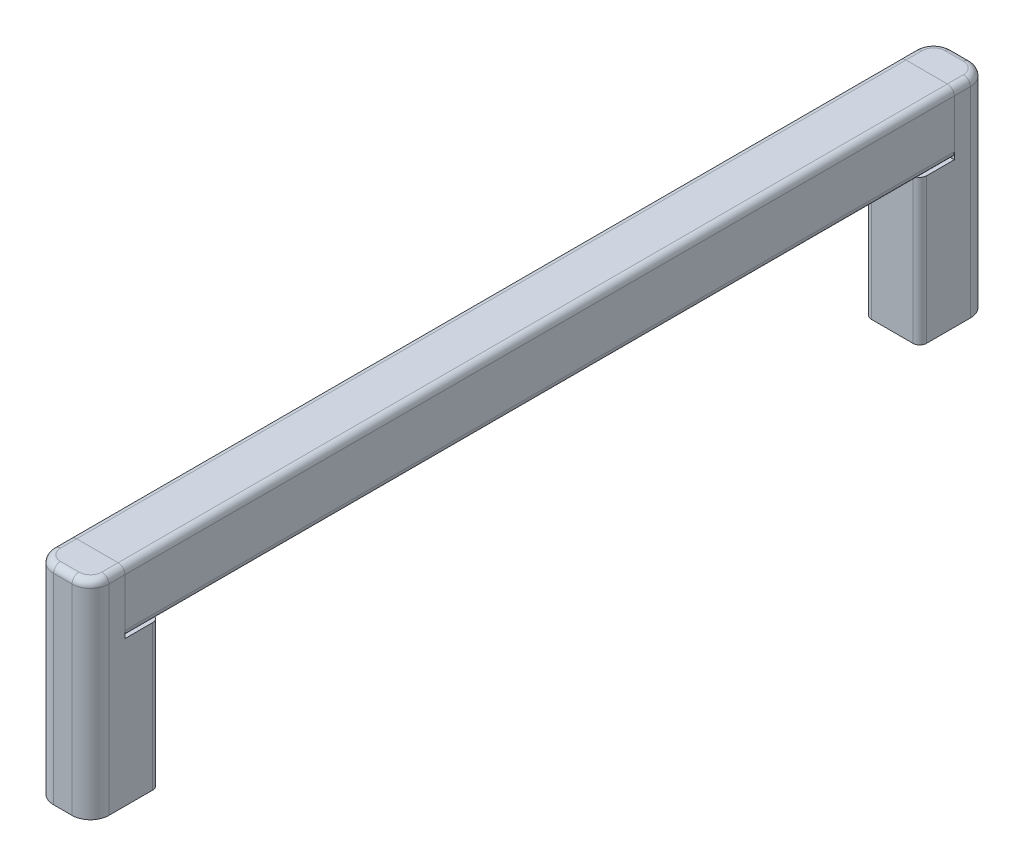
ISO-10303-21;
HEADER;
FILE_DESCRIPTION(('STEP AP214'),'2;1');
FILE_NAME('part.step','',(''),(''),'','','');
FILE_SCHEMA(('AUTOMOTIVE_DESIGN { 1 0 10303 214 1 1 1 1 }'));
ENDSEC;
DATA;
#1=APPLICATION_CONTEXT('core data for automotive mechanical design processes');
#2=APPLICATION_PROTOCOL_DEFINITION('international standard','automotive_design',2000,#1);
#3=PRODUCT_CONTEXT('',#1,'mechanical');
#4=PRODUCT('Part','Part','',(#3));
#5=PRODUCT_RELATED_PRODUCT_CATEGORY('part','',(#4));
#6=PRODUCT_DEFINITION_FORMATION('','',#4);
#7=PRODUCT_DEFINITION_CONTEXT('part definition',#1,'design');
#8=PRODUCT_DEFINITION('design','',#6,#7);
#9=PRODUCT_DEFINITION_SHAPE('','',#8);
#10=(LENGTH_UNIT() NAMED_UNIT(*) SI_UNIT(.MILLI.,.METRE.));
#11=(NAMED_UNIT(*) PLANE_ANGLE_UNIT() SI_UNIT($,.RADIAN.));
#12=(NAMED_UNIT(*) SI_UNIT($,.STERADIAN.) SOLID_ANGLE_UNIT());
#13=UNCERTAINTY_MEASURE_WITH_UNIT(LENGTH_MEASURE(1.E-05),#10,'distance_accuracy_value','');
#14=(GEOMETRIC_REPRESENTATION_CONTEXT(3) GLOBAL_UNCERTAINTY_ASSIGNED_CONTEXT((#13)) GLOBAL_UNIT_ASSIGNED_CONTEXT((#10,
#11,#12)) REPRESENTATION_CONTEXT('',''));
#15=CARTESIAN_POINT('',(0.,0.,0.));
#16=DIRECTION('',(0.,0.,1.));
#17=DIRECTION('',(1.,0.,0.));
#18=AXIS2_PLACEMENT_3D('',#15,#16,#17);
#19=CARTESIAN_POINT('',(-3.,3.50000000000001,60.));
#20=DIRECTION('',(0.,0.,1.));
#21=DIRECTION('',(1.,0.,0.));
#22=AXIS2_PLACEMENT_3D('',#19,#20,#21);
#23=PLANE('',#22);
#24=CARTESIAN_POINT('',(-3.,3.50000000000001,60.));
#25=DIRECTION('',(0.,0.,1.));
#26=DIRECTION('',(1.,0.,0.));
#27=AXIS2_PLACEMENT_3D('',#24,#25,#26);
#28=CIRCLE('',#27,1.);
#29=CARTESIAN_POINT('',(-3.,4.50000000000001,60.));
#30=VERTEX_POINT('',#29);
#31=CARTESIAN_POINT('',(-4.,3.50000000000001,60.));
#32=VERTEX_POINT('',#31);
#33=EDGE_CURVE('P0_E140',#30,#32,#28,.T.);
#34=ORIENTED_EDGE('',*,*,#33,.T.);
#35=DIRECTION('',(0.,-1.,0.));
#36=VECTOR('',#35,1.);
#37=CARTESIAN_POINT('',(-4.,3.50000000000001,60.));
#38=LINE('',#37,#36);
#39=CARTESIAN_POINT('',(-4.,-3.49999999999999,60.));
#40=VERTEX_POINT('',#39);
#41=EDGE_CURVE('P0_E129',#32,#40,#38,.T.);
#42=ORIENTED_EDGE('',*,*,#41,.T.);
#43=CARTESIAN_POINT('',(-3.,-3.49999999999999,60.));
#44=DIRECTION('',(0.,0.,1.));
#45=DIRECTION('',(1.,0.,0.));
#46=AXIS2_PLACEMENT_3D('',#43,#44,#45);
#47=CIRCLE('',#46,1.);
#48=CARTESIAN_POINT('',(-3.,-4.49999999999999,60.));
#49=VERTEX_POINT('',#48);
#50=EDGE_CURVE('P0_E139',#40,#49,#47,.T.);
#51=ORIENTED_EDGE('',*,*,#50,.T.);
#52=DIRECTION('',(1.,0.,0.));
#53=VECTOR('',#52,1.);
#54=CARTESIAN_POINT('',(-3.,-4.49999999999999,60.));
#55=LINE('',#54,#53);
#56=CARTESIAN_POINT('',(3.,-4.49999999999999,60.));
#57=VERTEX_POINT('',#56);
#58=EDGE_CURVE('P0_E224',#49,#57,#55,.T.);
#59=ORIENTED_EDGE('',*,*,#58,.T.);
#60=CARTESIAN_POINT('',(3.,-3.49999999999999,60.));
#61=DIRECTION('',(0.,0.,1.));
#62=DIRECTION('',(1.,0.,0.));
#63=AXIS2_PLACEMENT_3D('',#60,#61,#62);
#64=CIRCLE('',#63,1.);
#65=CARTESIAN_POINT('',(4.,-3.49999999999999,60.));
#66=VERTEX_POINT('',#65);
#67=EDGE_CURVE('P0_E226',#57,#66,#64,.T.);
#68=ORIENTED_EDGE('',*,*,#67,.T.);
#69=DIRECTION('',(0.,1.,0.));
#70=VECTOR('',#69,1.);
#71=CARTESIAN_POINT('',(4.,3.50000000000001,60.));
#72=LINE('',#71,#70);
#73=CARTESIAN_POINT('',(4.,3.50000000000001,60.));
#74=VERTEX_POINT('',#73);
#75=EDGE_CURVE('P0_E228',#66,#74,#72,.T.);
#76=ORIENTED_EDGE('',*,*,#75,.T.);
#77=CARTESIAN_POINT('',(3.,3.50000000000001,60.));
#78=DIRECTION('',(0.,0.,1.));
#79=DIRECTION('',(-1.,0.,0.));
#80=AXIS2_PLACEMENT_3D('',#77,#78,#79);
#81=CIRCLE('',#80,1.);
#82=CARTESIAN_POINT('',(3.,4.50000000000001,60.));
#83=VERTEX_POINT('',#82);
#84=EDGE_CURVE('P0_E230',#74,#83,#81,.T.);
#85=ORIENTED_EDGE('',*,*,#84,.T.);
#86=DIRECTION('',(-1.,0.,0.));
#87=VECTOR('',#86,1.);
#88=CARTESIAN_POINT('',(-3.,4.50000000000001,60.));
#89=LINE('',#88,#87);
#90=EDGE_CURVE('P0_E144',#83,#30,#89,.T.);
#91=ORIENTED_EDGE('',*,*,#90,.T.);
#92=EDGE_LOOP('',(#34,#42,#51,#59,#68,#76,#85,#91));
#93=FACE_BOUND('',#92,.T.);
#94=DIRECTION('',(-1.,0.,0.));
#95=VECTOR('',#94,1.);
#96=CARTESIAN_POINT('',(-1.33333333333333,1.5,60.));
#97=LINE('',#96,#95);
#98=CARTESIAN_POINT('',(0.833333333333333,1.5,60.));
#99=VERTEX_POINT('',#98);
#100=CARTESIAN_POINT('',(-0.833333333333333,1.5,60.));
#101=VERTEX_POINT('',#100);
#102=EDGE_CURVE('P0_E206',#99,#101,#97,.T.);
#103=ORIENTED_EDGE('',*,*,#102,.F.);
#104=CARTESIAN_POINT('',(0.833333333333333,1.,60.));
#105=DIRECTION('',(0.,0.,1.));
#106=DIRECTION('',(1.,0.,0.));
#107=AXIS2_PLACEMENT_3D('',#104,#105,#106);
#108=CIRCLE('',#107,0.5);
#109=CARTESIAN_POINT('',(1.33333333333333,1.,60.));
#110=VERTEX_POINT('',#109);
#111=EDGE_CURVE('P0_E187',#99,#110,#108,.F.);
#112=ORIENTED_EDGE('',*,*,#111,.T.);
#113=DIRECTION('',(0.,1.,0.));
#114=VECTOR('',#113,1.);
#115=CARTESIAN_POINT('',(1.33333333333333,-1.5,60.));
#116=LINE('',#115,#114);
#117=CARTESIAN_POINT('',(1.33333333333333,-0.999999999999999,60.));
#118=VERTEX_POINT('',#117);
#119=EDGE_CURVE('P0_E209',#118,#110,#116,.T.);
#120=ORIENTED_EDGE('',*,*,#119,.F.);
#121=CARTESIAN_POINT('',(0.833333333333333,-0.999999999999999,60.));
#122=DIRECTION('',(0.,0.,1.));
#123=DIRECTION('',(1.,0.,0.));
#124=AXIS2_PLACEMENT_3D('',#121,#122,#123);
#125=CIRCLE('',#124,0.5);
#126=CARTESIAN_POINT('',(0.833333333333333,-1.5,60.));
#127=VERTEX_POINT('',#126);
#128=EDGE_CURVE('P0_E183',#118,#127,#125,.F.);
#129=ORIENTED_EDGE('',*,*,#128,.T.);
#130=DIRECTION('',(1.,0.,0.));
#131=VECTOR('',#130,1.);
#132=CARTESIAN_POINT('',(-1.33333333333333,-1.5,60.));
#133=LINE('',#132,#131);
#134=CARTESIAN_POINT('',(-0.833333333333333,-1.5,60.));
#135=VERTEX_POINT('',#134);
#136=EDGE_CURVE('P0_E211',#135,#127,#133,.T.);
#137=ORIENTED_EDGE('',*,*,#136,.F.);
#138=CARTESIAN_POINT('',(-0.833333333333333,-0.999999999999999,60.));
#139=DIRECTION('',(0.,0.,1.));
#140=DIRECTION('',(1.,0.,0.));
#141=AXIS2_PLACEMENT_3D('',#138,#139,#140);
#142=CIRCLE('',#141,0.5);
#143=CARTESIAN_POINT('',(-1.33333333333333,-0.999999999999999,60.));
#144=VERTEX_POINT('',#143);
#145=EDGE_CURVE('P0_E179',#135,#144,#142,.F.);
#146=ORIENTED_EDGE('',*,*,#145,.T.);
#147=DIRECTION('',(0.,-1.,0.));
#148=VECTOR('',#147,1.);
#149=CARTESIAN_POINT('',(-1.33333333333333,-1.5,60.));
#150=LINE('',#149,#148);
#151=CARTESIAN_POINT('',(-1.33333333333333,1.,60.));
#152=VERTEX_POINT('',#151);
#153=EDGE_CURVE('P0_E208',#152,#144,#150,.T.);
#154=ORIENTED_EDGE('',*,*,#153,.F.);
#155=CARTESIAN_POINT('',(-0.833333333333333,0.999999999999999,60.));
#156=DIRECTION('',(0.,0.,1.));
#157=DIRECTION('',(1.,0.,0.));
#158=AXIS2_PLACEMENT_3D('',#155,#156,#157);
#159=CIRCLE('',#158,0.5);
#160=EDGE_CURVE('P0_E11',#152,#101,#159,.F.);
#161=ORIENTED_EDGE('',*,*,#160,.T.);
#162=EDGE_LOOP('',(#103,#112,#120,#129,#137,#146,#154,#161));
#163=FACE_BOUND('',#162,.T.);
#164=ADVANCED_FACE('P0_F16',(#93,#163),#23,.T.);
#165=CARTESIAN_POINT('',(-3.,3.50000000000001,-60.));
#166=DIRECTION('',(0.,0.,1.));
#167=DIRECTION('',(1.,0.,0.));
#168=AXIS2_PLACEMENT_3D('',#165,#166,#167);
#169=PLANE('',#168);
#170=CARTESIAN_POINT('',(-3.,3.50000000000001,-60.));
#171=DIRECTION('',(0.,0.,1.));
#172=DIRECTION('',(1.,0.,0.));
#173=AXIS2_PLACEMENT_3D('',#170,#171,#172);
#174=CIRCLE('',#173,1.);
#175=CARTESIAN_POINT('',(-3.,4.50000000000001,-60.));
#176=VERTEX_POINT('',#175);
#177=CARTESIAN_POINT('',(-4.,3.50000000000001,-60.));
#178=VERTEX_POINT('',#177);
#179=EDGE_CURVE('P0_E152',#176,#178,#174,.T.);
#180=ORIENTED_EDGE('',*,*,#179,.F.);
#181=DIRECTION('',(-1.,0.,0.));
#182=VECTOR('',#181,1.);
#183=CARTESIAN_POINT('',(-3.,4.50000000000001,-60.));
#184=LINE('',#183,#182);
#185=CARTESIAN_POINT('',(3.,4.50000000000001,-60.));
#186=VERTEX_POINT('',#185);
#187=EDGE_CURVE('P0_E148',#186,#176,#184,.T.);
#188=ORIENTED_EDGE('',*,*,#187,.F.);
#189=CARTESIAN_POINT('',(3.,3.50000000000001,-60.));
#190=DIRECTION('',(0.,0.,1.));
#191=DIRECTION('',(-1.,0.,0.));
#192=AXIS2_PLACEMENT_3D('',#189,#190,#191);
#193=CIRCLE('',#192,1.);
#194=CARTESIAN_POINT('',(4.,3.50000000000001,-60.));
#195=VERTEX_POINT('',#194);
#196=EDGE_CURVE('P0_E245',#195,#186,#193,.T.);
#197=ORIENTED_EDGE('',*,*,#196,.F.);
#198=DIRECTION('',(0.,1.,0.));
#199=VECTOR('',#198,1.);
#200=CARTESIAN_POINT('',(4.,3.50000000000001,-60.));
#201=LINE('',#200,#199);
#202=CARTESIAN_POINT('',(4.,-3.49999999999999,-60.));
#203=VERTEX_POINT('',#202);
#204=EDGE_CURVE('P0_E243',#203,#195,#201,.T.);
#205=ORIENTED_EDGE('',*,*,#204,.F.);
#206=CARTESIAN_POINT('',(3.,-3.49999999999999,-60.));
#207=DIRECTION('',(0.,0.,1.));
#208=DIRECTION('',(1.,0.,0.));
#209=AXIS2_PLACEMENT_3D('',#206,#207,#208);
#210=CIRCLE('',#209,1.);
#211=CARTESIAN_POINT('',(3.,-4.49999999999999,-60.));
#212=VERTEX_POINT('',#211);
#213=EDGE_CURVE('P0_E241',#212,#203,#210,.T.);
#214=ORIENTED_EDGE('',*,*,#213,.F.);
#215=DIRECTION('',(1.,0.,0.));
#216=VECTOR('',#215,1.);
#217=CARTESIAN_POINT('',(-3.,-4.49999999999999,-60.));
#218=LINE('',#217,#216);
#219=CARTESIAN_POINT('',(-3.,-4.49999999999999,-60.));
#220=VERTEX_POINT('',#219);
#221=EDGE_CURVE('P0_E239',#220,#212,#218,.T.);
#222=ORIENTED_EDGE('',*,*,#221,.F.);
#223=CARTESIAN_POINT('',(-3.,-3.49999999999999,-60.));
#224=DIRECTION('',(0.,0.,1.));
#225=DIRECTION('',(1.,0.,0.));
#226=AXIS2_PLACEMENT_3D('',#223,#224,#225);
#227=CIRCLE('',#226,1.);
#228=CARTESIAN_POINT('',(-4.,-3.49999999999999,-60.));
#229=VERTEX_POINT('',#228);
#230=EDGE_CURVE('P0_E237',#229,#220,#227,.T.);
#231=ORIENTED_EDGE('',*,*,#230,.F.);
#232=DIRECTION('',(0.,-1.,0.));
#233=VECTOR('',#232,1.);
#234=CARTESIAN_POINT('',(-4.,3.50000000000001,-60.));
#235=LINE('',#234,#233);
#236=EDGE_CURVE('P0_E235',#178,#229,#235,.T.);
#237=ORIENTED_EDGE('',*,*,#236,.F.);
#238=EDGE_LOOP('',(#180,#188,#197,#205,#214,#222,#231,#237));
#239=FACE_BOUND('',#238,.T.);
#240=DIRECTION('',(1.,0.,0.));
#241=VECTOR('',#240,1.);
#242=CARTESIAN_POINT('',(-1.33333333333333,-1.5,-60.));
#243=LINE('',#242,#241);
#244=CARTESIAN_POINT('',(-0.833333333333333,-1.5,-60.));
#245=VERTEX_POINT('',#244);
#246=CARTESIAN_POINT('',(0.833333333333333,-1.5,-60.));
#247=VERTEX_POINT('',#246);
#248=EDGE_CURVE('P0_E203',#245,#247,#243,.T.);
#249=ORIENTED_EDGE('',*,*,#248,.T.);
#250=CARTESIAN_POINT('',(0.833333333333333,-0.999999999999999,-60.));
#251=DIRECTION('',(0.,0.,1.));
#252=DIRECTION('',(1.,0.,0.));
#253=AXIS2_PLACEMENT_3D('',#250,#251,#252);
#254=CIRCLE('',#253,0.5);
#255=CARTESIAN_POINT('',(1.33333333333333,-0.999999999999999,-60.));
#256=VERTEX_POINT('',#255);
#257=EDGE_CURVE('P0_E181',#247,#256,#254,.T.);
#258=ORIENTED_EDGE('',*,*,#257,.T.);
#259=DIRECTION('',(0.,1.,0.));
#260=VECTOR('',#259,1.);
#261=CARTESIAN_POINT('',(1.33333333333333,-1.5,-60.));
#262=LINE('',#261,#260);
#263=CARTESIAN_POINT('',(1.33333333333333,1.,-60.));
#264=VERTEX_POINT('',#263);
#265=EDGE_CURVE('P0_E218',#256,#264,#262,.T.);
#266=ORIENTED_EDGE('',*,*,#265,.T.);
#267=CARTESIAN_POINT('',(0.833333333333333,1.,-60.));
#268=DIRECTION('',(0.,0.,1.));
#269=DIRECTION('',(1.,0.,0.));
#270=AXIS2_PLACEMENT_3D('',#267,#268,#269);
#271=CIRCLE('',#270,0.5);
#272=CARTESIAN_POINT('',(0.833333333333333,1.5,-60.));
#273=VERTEX_POINT('',#272);
#274=EDGE_CURVE('P0_E185',#264,#273,#271,.T.);
#275=ORIENTED_EDGE('',*,*,#274,.T.);
#276=DIRECTION('',(-1.,0.,0.));
#277=VECTOR('',#276,1.);
#278=CARTESIAN_POINT('',(-1.33333333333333,1.5,-60.));
#279=LINE('',#278,#277);
#280=CARTESIAN_POINT('',(-0.833333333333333,1.5,-60.));
#281=VERTEX_POINT('',#280);
#282=EDGE_CURVE('P0_E195',#273,#281,#279,.T.);
#283=ORIENTED_EDGE('',*,*,#282,.T.);
#284=CARTESIAN_POINT('',(-0.833333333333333,0.999999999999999,-60.));
#285=DIRECTION('',(0.,0.,1.));
#286=DIRECTION('',(1.,0.,0.));
#287=AXIS2_PLACEMENT_3D('',#284,#285,#286);
#288=CIRCLE('',#287,0.5);
#289=CARTESIAN_POINT('',(-1.33333333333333,1.,-60.));
#290=VERTEX_POINT('',#289);
#291=EDGE_CURVE('P0_E24',#281,#290,#288,.T.);
#292=ORIENTED_EDGE('',*,*,#291,.T.);
#293=DIRECTION('',(0.,-1.,0.));
#294=VECTOR('',#293,1.);
#295=CARTESIAN_POINT('',(-1.33333333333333,-1.5,-60.));
#296=LINE('',#295,#294);
#297=CARTESIAN_POINT('',(-1.33333333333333,-0.999999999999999,-60.));
#298=VERTEX_POINT('',#297);
#299=EDGE_CURVE('P0_E194',#290,#298,#296,.T.);
#300=ORIENTED_EDGE('',*,*,#299,.T.);
#301=CARTESIAN_POINT('',(-0.833333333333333,-0.999999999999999,-60.));
#302=DIRECTION('',(0.,0.,1.));
#303=DIRECTION('',(1.,0.,0.));
#304=AXIS2_PLACEMENT_3D('',#301,#302,#303);
#305=CIRCLE('',#304,0.5);
#306=EDGE_CURVE('P0_E177',#298,#245,#305,.T.);
#307=ORIENTED_EDGE('',*,*,#306,.T.);
#308=EDGE_LOOP('',(#249,#258,#266,#275,#283,#292,#300,#307));
#309=FACE_BOUND('',#308,.T.);
#310=ADVANCED_FACE('P0_F193',(#239,#309),#169,.F.);
#311=CARTESIAN_POINT('',(-3.,3.50000000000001,60.));
#312=DIRECTION('',(0.,0.,-1.));
#313=DIRECTION('',(-1.,0.,0.));
#314=AXIS2_PLACEMENT_3D('',#311,#312,#313);
#315=CYLINDRICAL_SURFACE('',#314,1.);
#316=ORIENTED_EDGE('',*,*,#179,.T.);
#317=DIRECTION('',(0.,0.,-1.));
#318=VECTOR('',#317,1.);
#319=CARTESIAN_POINT('',(-4.,3.50000000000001,60.));
#320=LINE('',#319,#318);
#321=EDGE_CURVE('P0_E133',#32,#178,#320,.T.);
#322=ORIENTED_EDGE('',*,*,#321,.F.);
#323=ORIENTED_EDGE('',*,*,#33,.F.);
#324=DIRECTION('',(0.,0.,-1.));
#325=VECTOR('',#324,1.);
#326=CARTESIAN_POINT('',(-3.,4.50000000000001,60.));
#327=LINE('',#326,#325);
#328=EDGE_CURVE('P0_E233',#30,#176,#327,.T.);
#329=ORIENTED_EDGE('',*,*,#328,.T.);
#330=EDGE_LOOP('',(#316,#322,#323,#329));
#331=FACE_BOUND('',#330,.T.);
#332=ADVANCED_FACE('P0_F150',(#331),#315,.T.);
#333=CARTESIAN_POINT('',(-4.,3.50000000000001,60.));
#334=DIRECTION('',(1.,0.,0.));
#335=DIRECTION('',(0.,0.,-1.));
#336=AXIS2_PLACEMENT_3D('',#333,#334,#335);
#337=PLANE('',#336);
#338=ORIENTED_EDGE('',*,*,#236,.T.);
#339=DIRECTION('',(0.,0.,-1.));
#340=VECTOR('',#339,1.);
#341=CARTESIAN_POINT('',(-4.,-3.49999999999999,60.));
#342=LINE('',#341,#340);
#343=EDGE_CURVE('P0_E136',#40,#229,#342,.T.);
#344=ORIENTED_EDGE('',*,*,#343,.F.);
#345=ORIENTED_EDGE('',*,*,#41,.F.);
#346=ORIENTED_EDGE('',*,*,#321,.T.);
#347=EDGE_LOOP('',(#338,#344,#345,#346));
#348=FACE_BOUND('',#347,.T.);
#349=ADVANCED_FACE('P0_F131',(#348),#337,.F.);
#350=CARTESIAN_POINT('',(-3.,-3.49999999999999,60.));
#351=DIRECTION('',(0.,0.,-1.));
#352=DIRECTION('',(-1.,0.,0.));
#353=AXIS2_PLACEMENT_3D('',#350,#351,#352);
#354=CYLINDRICAL_SURFACE('',#353,1.);
#355=ORIENTED_EDGE('',*,*,#230,.T.);
#356=DIRECTION('',(0.,0.,-1.));
#357=VECTOR('',#356,1.);
#358=CARTESIAN_POINT('',(-3.,-4.49999999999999,60.));
#359=LINE('',#358,#357);
#360=EDGE_CURVE('P0_E157',#49,#220,#359,.T.);
#361=ORIENTED_EDGE('',*,*,#360,.F.);
#362=ORIENTED_EDGE('',*,*,#50,.F.);
#363=ORIENTED_EDGE('',*,*,#343,.T.);
#364=EDGE_LOOP('',(#355,#361,#362,#363));
#365=FACE_BOUND('',#364,.T.);
#366=ADVANCED_FACE('P0_F283',(#365),#354,.T.);
#367=CARTESIAN_POINT('',(-3.,-4.49999999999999,60.));
#368=DIRECTION('',(0.,1.,0.));
#369=DIRECTION('',(0.,0.,1.));
#370=AXIS2_PLACEMENT_3D('',#367,#368,#369);
#371=PLANE('',#370);
#372=ORIENTED_EDGE('',*,*,#221,.T.);
#373=DIRECTION('',(0.,0.,-1.));
#374=VECTOR('',#373,1.);
#375=CARTESIAN_POINT('',(3.,-4.49999999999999,60.));
#376=LINE('',#375,#374);
#377=EDGE_CURVE('P0_E258',#57,#212,#376,.T.);
#378=ORIENTED_EDGE('',*,*,#377,.F.);
#379=ORIENTED_EDGE('',*,*,#58,.F.);
#380=ORIENTED_EDGE('',*,*,#360,.T.);
#381=EDGE_LOOP('',(#372,#378,#379,#380));
#382=FACE_BOUND('',#381,.T.);
#383=ADVANCED_FACE('P0_F265',(#382),#371,.F.);
#384=CARTESIAN_POINT('',(3.,-3.49999999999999,60.));
#385=DIRECTION('',(0.,0.,-1.));
#386=DIRECTION('',(-1.,0.,0.));
#387=AXIS2_PLACEMENT_3D('',#384,#385,#386);
#388=CYLINDRICAL_SURFACE('',#387,1.);
#389=ORIENTED_EDGE('',*,*,#213,.T.);
#390=DIRECTION('',(0.,0.,-1.));
#391=VECTOR('',#390,1.);
#392=CARTESIAN_POINT('',(4.,-3.49999999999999,60.));
#393=LINE('',#392,#391);
#394=EDGE_CURVE('P0_E255',#66,#203,#393,.T.);
#395=ORIENTED_EDGE('',*,*,#394,.F.);
#396=ORIENTED_EDGE('',*,*,#67,.F.);
#397=ORIENTED_EDGE('',*,*,#377,.T.);
#398=EDGE_LOOP('',(#389,#395,#396,#397));
#399=FACE_BOUND('',#398,.T.);
#400=ADVANCED_FACE('P0_F275',(#399),#388,.T.);
#401=CARTESIAN_POINT('',(4.,3.50000000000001,60.));
#402=DIRECTION('',(-1.,0.,0.));
#403=DIRECTION('',(0.,0.,1.));
#404=AXIS2_PLACEMENT_3D('',#401,#402,#403);
#405=PLANE('',#404);
#406=ORIENTED_EDGE('',*,*,#204,.T.);
#407=DIRECTION('',(0.,0.,-1.));
#408=VECTOR('',#407,1.);
#409=CARTESIAN_POINT('',(4.,3.50000000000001,60.));
#410=LINE('',#409,#408);
#411=EDGE_CURVE('P0_E252',#74,#195,#410,.T.);
#412=ORIENTED_EDGE('',*,*,#411,.F.);
#413=ORIENTED_EDGE('',*,*,#75,.F.);
#414=ORIENTED_EDGE('',*,*,#394,.T.);
#415=EDGE_LOOP('',(#406,#412,#413,#414));
#416=FACE_BOUND('',#415,.T.);
#417=ADVANCED_FACE('P0_F279',(#416),#405,.F.);
#418=CARTESIAN_POINT('',(3.,3.50000000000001,60.));
#419=DIRECTION('',(0.,0.,-1.));
#420=DIRECTION('',(-1.,0.,0.));
#421=AXIS2_PLACEMENT_3D('',#418,#419,#420);
#422=CYLINDRICAL_SURFACE('',#421,1.);
#423=ORIENTED_EDGE('',*,*,#196,.T.);
#424=DIRECTION('',(0.,0.,-1.));
#425=VECTOR('',#424,1.);
#426=CARTESIAN_POINT('',(3.,4.50000000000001,60.));
#427=LINE('',#426,#425);
#428=EDGE_CURVE('P0_E249',#83,#186,#427,.T.);
#429=ORIENTED_EDGE('',*,*,#428,.F.);
#430=ORIENTED_EDGE('',*,*,#84,.F.);
#431=ORIENTED_EDGE('',*,*,#411,.T.);
#432=EDGE_LOOP('',(#423,#429,#430,#431));
#433=FACE_BOUND('',#432,.T.);
#434=ADVANCED_FACE('P0_F306',(#433),#422,.T.);
#435=CARTESIAN_POINT('',(-3.,4.50000000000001,60.));
#436=DIRECTION('',(0.,-1.,0.));
#437=DIRECTION('',(0.,0.,-1.));
#438=AXIS2_PLACEMENT_3D('',#435,#436,#437);
#439=PLANE('',#438);
#440=ORIENTED_EDGE('',*,*,#187,.T.);
#441=ORIENTED_EDGE('',*,*,#328,.F.);
#442=ORIENTED_EDGE('',*,*,#90,.F.);
#443=ORIENTED_EDGE('',*,*,#428,.T.);
#444=EDGE_LOOP('',(#440,#441,#442,#443));
#445=FACE_BOUND('',#444,.T.);
#446=ADVANCED_FACE('P0_F303',(#445),#439,.F.);
#447=CARTESIAN_POINT('',(1.33333333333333,-1.5,60.));
#448=DIRECTION('',(-1.,0.,0.));
#449=DIRECTION('',(0.,0.,1.));
#450=AXIS2_PLACEMENT_3D('',#447,#448,#449);
#451=PLANE('',#450);
#452=ORIENTED_EDGE('',*,*,#265,.F.);
#453=DIRECTION('',(0.,0.,-1.));
#454=VECTOR('',#453,1.);
#455=CARTESIAN_POINT('',(1.33333333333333,-0.999999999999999,60.));
#456=LINE('',#455,#454);
#457=EDGE_CURVE('P0_E171',#256,#118,#456,.F.);
#458=ORIENTED_EDGE('',*,*,#457,.T.);
#459=ORIENTED_EDGE('',*,*,#119,.T.);
#460=DIRECTION('',(0.,0.,-1.));
#461=VECTOR('',#460,1.);
#462=CARTESIAN_POINT('',(1.33333333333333,1.,-60.));
#463=LINE('',#462,#461);
#464=EDGE_CURVE('P0_E168',#110,#264,#463,.T.);
#465=ORIENTED_EDGE('',*,*,#464,.T.);
#466=EDGE_LOOP('',(#452,#458,#459,#465));
#467=FACE_BOUND('',#466,.T.);
#468=ADVANCED_FACE('P0_F300',(#467),#451,.T.);
#469=CARTESIAN_POINT('',(-1.33333333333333,1.5,60.));
#470=DIRECTION('',(0.,-1.,0.));
#471=DIRECTION('',(1.,0.,0.));
#472=AXIS2_PLACEMENT_3D('',#469,#470,#471);
#473=PLANE('',#472);
#474=ORIENTED_EDGE('',*,*,#282,.F.);
#475=DIRECTION('',(0.,0.,-1.));
#476=VECTOR('',#475,1.);
#477=CARTESIAN_POINT('',(0.833333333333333,1.5,60.));
#478=LINE('',#477,#476);
#479=EDGE_CURVE('P0_E36',#273,#99,#478,.F.);
#480=ORIENTED_EDGE('',*,*,#479,.T.);
#481=ORIENTED_EDGE('',*,*,#102,.T.);
#482=DIRECTION('',(0.,0.,-1.));
#483=VECTOR('',#482,1.);
#484=CARTESIAN_POINT('',(-0.833333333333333,1.5,-60.));
#485=LINE('',#484,#483);
#486=EDGE_CURVE('P0_E173',#101,#281,#485,.T.);
#487=ORIENTED_EDGE('',*,*,#486,.T.);
#488=EDGE_LOOP('',(#474,#480,#481,#487));
#489=FACE_BOUND('',#488,.T.);
#490=ADVANCED_FACE('P0_F205',(#489),#473,.T.);
#491=CARTESIAN_POINT('',(-1.33333333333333,-1.5,60.));
#492=DIRECTION('',(1.,0.,0.));
#493=DIRECTION('',(0.,0.,-1.));
#494=AXIS2_PLACEMENT_3D('',#491,#492,#493);
#495=PLANE('',#494);
#496=ORIENTED_EDGE('',*,*,#153,.T.);
#497=DIRECTION('',(0.,0.,-1.));
#498=VECTOR('',#497,1.);
#499=CARTESIAN_POINT('',(-1.33333333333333,-0.999999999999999,-60.));
#500=LINE('',#499,#498);
#501=EDGE_CURVE('P0_E155',#144,#298,#500,.T.);
#502=ORIENTED_EDGE('',*,*,#501,.T.);
#503=ORIENTED_EDGE('',*,*,#299,.F.);
#504=DIRECTION('',(0.,0.,-1.));
#505=VECTOR('',#504,1.);
#506=CARTESIAN_POINT('',(-1.33333333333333,0.999999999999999,60.));
#507=LINE('',#506,#505);
#508=EDGE_CURVE('P0_E153',#290,#152,#507,.F.);
#509=ORIENTED_EDGE('',*,*,#508,.T.);
#510=EDGE_LOOP('',(#496,#502,#503,#509));
#511=FACE_BOUND('',#510,.T.);
#512=ADVANCED_FACE('P0_F201',(#511),#495,.T.);
#513=CARTESIAN_POINT('',(-1.33333333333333,-1.5,60.));
#514=DIRECTION('',(0.,1.,0.));
#515=DIRECTION('',(0.,0.,1.));
#516=AXIS2_PLACEMENT_3D('',#513,#514,#515);
#517=PLANE('',#516);
#518=ORIENTED_EDGE('',*,*,#248,.F.);
#519=DIRECTION('',(0.,0.,-1.));
#520=VECTOR('',#519,1.);
#521=CARTESIAN_POINT('',(-0.833333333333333,-1.5,60.));
#522=LINE('',#521,#520);
#523=EDGE_CURVE('P0_E166',#245,#135,#522,.F.);
#524=ORIENTED_EDGE('',*,*,#523,.T.);
#525=ORIENTED_EDGE('',*,*,#136,.T.);
#526=DIRECTION('',(0.,0.,-1.));
#527=VECTOR('',#526,1.);
#528=CARTESIAN_POINT('',(0.833333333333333,-1.5,-60.));
#529=LINE('',#528,#527);
#530=EDGE_CURVE('P0_E163',#127,#247,#529,.T.);
#531=ORIENTED_EDGE('',*,*,#530,.T.);
#532=EDGE_LOOP('',(#518,#524,#525,#531));
#533=FACE_BOUND('',#532,.T.);
#534=ADVANCED_FACE('P0_F355',(#533),#517,.T.);
#535=CARTESIAN_POINT('',(-0.833333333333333,-0.999999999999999,60.));
#536=DIRECTION('',(0.,0.,1.));
#537=DIRECTION('',(1.,0.,0.));
#538=AXIS2_PLACEMENT_3D('',#535,#536,#537);
#539=CYLINDRICAL_SURFACE('',#538,0.5);
#540=ORIENTED_EDGE('',*,*,#145,.F.);
#541=ORIENTED_EDGE('',*,*,#523,.F.);
#542=ORIENTED_EDGE('',*,*,#306,.F.);
#543=ORIENTED_EDGE('',*,*,#501,.F.);
#544=EDGE_LOOP('',(#540,#541,#542,#543));
#545=FACE_BOUND('',#544,.T.);
#546=ADVANCED_FACE('P0_F363',(#545),#539,.F.);
#547=CARTESIAN_POINT('',(0.833333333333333,-0.999999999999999,60.));
#548=DIRECTION('',(0.,0.,1.));
#549=DIRECTION('',(1.,0.,0.));
#550=AXIS2_PLACEMENT_3D('',#547,#548,#549);
#551=CYLINDRICAL_SURFACE('',#550,0.5);
#552=ORIENTED_EDGE('',*,*,#128,.F.);
#553=ORIENTED_EDGE('',*,*,#457,.F.);
#554=ORIENTED_EDGE('',*,*,#257,.F.);
#555=ORIENTED_EDGE('',*,*,#530,.F.);
#556=EDGE_LOOP('',(#552,#553,#554,#555));
#557=FACE_BOUND('',#556,.T.);
#558=ADVANCED_FACE('P0_F372',(#557),#551,.F.);
#559=CARTESIAN_POINT('',(0.833333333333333,1.,60.));
#560=DIRECTION('',(0.,0.,1.));
#561=DIRECTION('',(1.,0.,0.));
#562=AXIS2_PLACEMENT_3D('',#559,#560,#561);
#563=CYLINDRICAL_SURFACE('',#562,0.5);
#564=ORIENTED_EDGE('',*,*,#111,.F.);
#565=ORIENTED_EDGE('',*,*,#479,.F.);
#566=ORIENTED_EDGE('',*,*,#274,.F.);
#567=ORIENTED_EDGE('',*,*,#464,.F.);
#568=EDGE_LOOP('',(#564,#565,#566,#567));
#569=FACE_BOUND('',#568,.T.);
#570=ADVANCED_FACE('P0_F381',(#569),#563,.F.);
#571=CARTESIAN_POINT('',(-0.833333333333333,0.999999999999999,60.));
#572=DIRECTION('',(0.,0.,1.));
#573=DIRECTION('',(1.,0.,0.));
#574=AXIS2_PLACEMENT_3D('',#571,#572,#573);
#575=CYLINDRICAL_SURFACE('',#574,0.5);
#576=ORIENTED_EDGE('',*,*,#160,.F.);
#577=ORIENTED_EDGE('',*,*,#508,.F.);
#578=ORIENTED_EDGE('',*,*,#291,.F.);
#579=ORIENTED_EDGE('',*,*,#486,.F.);
#580=EDGE_LOOP('',(#576,#577,#578,#579));
#581=FACE_BOUND('',#580,.T.);
#582=ADVANCED_FACE('P0_F18',(#581),#575,.F.);
#583=CLOSED_SHELL('',(#164,#310,#332,#349,#366,#383,#400,#417,#434,#446,#468,#490,#512,#534,
#546,#558,#570,#582));
#584=MANIFOLD_SOLID_BREP('P0_B1',#583);
#585=CARTESIAN_POINT('',(0.,-25.5,-60.));
#586=DIRECTION('',(0.,1.,0.));
#587=DIRECTION('',(-1.,0.,0.));
#588=AXIS2_PLACEMENT_3D('',#585,#586,#587);
#589=CYLINDRICAL_SURFACE('',#588,3.24999999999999);
#590=CARTESIAN_POINT('',(0.,-11.2769088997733,-60.));
#591=DIRECTION('',(0.,1.,0.));
#592=DIRECTION('',(-1.,0.,0.));
#593=AXIS2_PLACEMENT_3D('',#590,#591,#592);
#594=CIRCLE('',#593,3.24999999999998);
#595=CARTESIAN_POINT('',(-3.24999999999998,-11.2769088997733,-60.));
#596=VERTEX_POINT('',#595);
#597=EDGE_CURVE('P1_E11',#596,#596,#594,.T.);
#598=ORIENTED_EDGE('',*,*,#597,.F.);
#599=EDGE_LOOP('',(#598));
#600=FACE_BOUND('',#599,.T.);
#601=CARTESIAN_POINT('',(0.,-25.5,-60.));
#602=DIRECTION('',(0.,1.,0.));
#603=DIRECTION('',(-1.,0.,0.));
#604=AXIS2_PLACEMENT_3D('',#601,#602,#603);
#605=CIRCLE('',#604,3.25);
#606=CARTESIAN_POINT('',(-3.25,-25.5,-60.));
#607=VERTEX_POINT('',#606);
#608=EDGE_CURVE('P1_E51',#607,#607,#605,.T.);
#609=ORIENTED_EDGE('',*,*,#608,.T.);
#610=EDGE_LOOP('',(#609));
#611=FACE_BOUND('',#610,.T.);
#612=ADVANCED_FACE('P1_F16',(#600,#611),#589,.T.);
#613=CARTESIAN_POINT('',(0.,-11.2769088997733,-60.));
#614=DIRECTION('',(0.,1.,0.));
#615=DIRECTION('',(-1.,0.,0.));
#616=AXIS2_PLACEMENT_3D('',#613,#614,#615);
#617=TOROIDAL_SURFACE('',#616,2.25,0.999999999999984);
#618=CARTESIAN_POINT('',(0.,-10.2807142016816,-60.));
#619=DIRECTION('',(0.,1.,0.));
#620=DIRECTION('',(-1.,0.,0.));
#621=AXIS2_PLACEMENT_3D('',#618,#619,#620);
#622=CIRCLE('',#621,2.33715574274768);
#623=CARTESIAN_POINT('',(-2.33715574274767,-10.2807142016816,-60.));
#624=VERTEX_POINT('',#623);
#625=EDGE_CURVE('P1_E23',#624,#624,#622,.T.);
#626=ORIENTED_EDGE('',*,*,#625,.F.);
#627=EDGE_LOOP('',(#626));
#628=FACE_BOUND('',#627,.T.);
#629=ORIENTED_EDGE('',*,*,#597,.T.);
#630=EDGE_LOOP('',(#629));
#631=FACE_BOUND('',#630,.T.);
#632=ADVANCED_FACE('P1_F33',(#628,#631),#617,.T.);
#633=CARTESIAN_POINT('',(0.,-10.2807142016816,-60.));
#634=DIRECTION('',(0.,-1.,0.));
#635=DIRECTION('',(1.,0.,0.));
#636=AXIS2_PLACEMENT_3D('',#633,#634,#635);
#637=CONICAL_SURFACE('',#636,2.33715574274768,1.48352986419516);
#638=CARTESIAN_POINT('',(0.,-10.0762395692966,-60.));
#639=VERTEX_POINT('',#638);
#640=VERTEX_LOOP('',#639);
#641=FACE_BOUND('',#640,.T.);
#642=ORIENTED_EDGE('',*,*,#625,.T.);
#643=EDGE_LOOP('',(#642));
#644=FACE_BOUND('',#643,.T.);
#645=ADVANCED_FACE('P1_F29',(#641,#644),#637,.T.);
#646=CARTESIAN_POINT('',(0.,-13.5762395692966,-60.));
#647=DIRECTION('',(0.,-1.,0.));
#648=DIRECTION('',(1.,0.,0.));
#649=AXIS2_PLACEMENT_3D('',#646,#647,#648);
#650=CONICAL_SURFACE('',#649,0.,1.04719755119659);
#651=CARTESIAN_POINT('',(0.,-14.5,-60.));
#652=DIRECTION('',(0.,1.,0.));
#653=DIRECTION('',(-1.,0.,0.));
#654=AXIS2_PLACEMENT_3D('',#651,#652,#653);
#655=CIRCLE('',#654,1.6);
#656=CARTESIAN_POINT('',(-1.6,-14.5,-60.));
#657=VERTEX_POINT('',#656);
#658=EDGE_CURVE('P1_E38',#657,#657,#655,.T.);
#659=ORIENTED_EDGE('',*,*,#658,.F.);
#660=EDGE_LOOP('',(#659));
#661=FACE_BOUND('',#660,.T.);
#662=CARTESIAN_POINT('',(0.,-13.5762395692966,-60.));
#663=VERTEX_POINT('',#662);
#664=VERTEX_LOOP('',#663);
#665=FACE_BOUND('',#664,.T.);
#666=ADVANCED_FACE('P1_F32',(#661,#665),#650,.F.);
#667=CARTESIAN_POINT('',(0.,-25.5,-60.));
#668=DIRECTION('',(0.,1.,0.));
#669=DIRECTION('',(-1.,0.,0.));
#670=AXIS2_PLACEMENT_3D('',#667,#668,#669);
#671=CYLINDRICAL_SURFACE('',#670,1.6);
#672=CARTESIAN_POINT('',(0.,-17.5,-60.));
#673=DIRECTION('',(0.,1.,0.));
#674=DIRECTION('',(-1.,0.,0.));
#675=AXIS2_PLACEMENT_3D('',#672,#673,#674);
#676=CIRCLE('',#675,1.6);
#677=CARTESIAN_POINT('',(-1.6,-17.5,-60.));
#678=VERTEX_POINT('',#677);
#679=EDGE_CURVE('P1_E40',#678,#678,#676,.T.);
#680=ORIENTED_EDGE('',*,*,#679,.F.);
#681=EDGE_LOOP('',(#680));
#682=FACE_BOUND('',#681,.T.);
#683=ORIENTED_EDGE('',*,*,#658,.T.);
#684=EDGE_LOOP('',(#683));
#685=FACE_BOUND('',#684,.T.);
#686=ADVANCED_FACE('P1_F71',(#682,#685),#671,.F.);
#687=CARTESIAN_POINT('',(0.,-17.5,-58.));
#688=DIRECTION('',(0.,1.,0.));
#689=DIRECTION('',(-1.,0.,0.));
#690=AXIS2_PLACEMENT_3D('',#687,#688,#689);
#691=PLANE('',#690);
#692=CARTESIAN_POINT('',(0.,-17.5,-60.));
#693=DIRECTION('',(0.,1.,0.));
#694=DIRECTION('',(-1.,0.,0.));
#695=AXIS2_PLACEMENT_3D('',#692,#693,#694);
#696=CIRCLE('',#695,2.);
#697=CARTESIAN_POINT('',(-2.,-17.5,-60.));
#698=VERTEX_POINT('',#697);
#699=EDGE_CURVE('P1_E45',#698,#698,#696,.T.);
#700=ORIENTED_EDGE('',*,*,#699,.F.);
#701=EDGE_LOOP('',(#700));
#702=FACE_BOUND('',#701,.T.);
#703=ORIENTED_EDGE('',*,*,#679,.T.);
#704=EDGE_LOOP('',(#703));
#705=FACE_BOUND('',#704,.T.);
#706=ADVANCED_FACE('P1_F65',(#702,#705),#691,.F.);
#707=CARTESIAN_POINT('',(0.,-25.5,-60.));
#708=DIRECTION('',(0.,1.,0.));
#709=DIRECTION('',(-1.,0.,0.));
#710=AXIS2_PLACEMENT_3D('',#707,#708,#709);
#711=CYLINDRICAL_SURFACE('',#710,2.);
#712=CARTESIAN_POINT('',(0.,-25.5,-60.));
#713=DIRECTION('',(0.,1.,0.));
#714=DIRECTION('',(-1.,0.,0.));
#715=AXIS2_PLACEMENT_3D('',#712,#713,#714);
#716=CIRCLE('',#715,2.);
#717=CARTESIAN_POINT('',(-2.,-25.5,-60.));
#718=VERTEX_POINT('',#717);
#719=EDGE_CURVE('P1_E48',#718,#718,#716,.T.);
#720=ORIENTED_EDGE('',*,*,#719,.F.);
#721=EDGE_LOOP('',(#720));
#722=FACE_BOUND('',#721,.T.);
#723=ORIENTED_EDGE('',*,*,#699,.T.);
#724=EDGE_LOOP('',(#723));
#725=FACE_BOUND('',#724,.T.);
#726=ADVANCED_FACE('P1_F59',(#722,#725),#711,.F.);
#727=CARTESIAN_POINT('',(0.,-25.5,-58.));
#728=DIRECTION('',(0.,1.,0.));
#729=DIRECTION('',(-1.,0.,0.));
#730=AXIS2_PLACEMENT_3D('',#727,#728,#729);
#731=PLANE('',#730);
#732=ORIENTED_EDGE('',*,*,#608,.F.);
#733=EDGE_LOOP('',(#732));
#734=FACE_BOUND('',#733,.T.);
#735=ORIENTED_EDGE('',*,*,#719,.T.);
#736=EDGE_LOOP('',(#735));
#737=FACE_BOUND('',#736,.T.);
#738=ADVANCED_FACE('P1_F56',(#734,#737),#731,.F.);
#739=CLOSED_SHELL('',(#612,#632,#645,#666,#686,#706,#726,#738));
#740=MANIFOLD_SOLID_BREP('P1_B1',#739);
#741=CARTESIAN_POINT('',(-1.33333333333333,-25.5,-62.3333333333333));
#742=DIRECTION('',(0.,1.,0.));
#743=DIRECTION('',(-1.,0.,0.));
#744=AXIS2_PLACEMENT_3D('',#741,#742,#743);
#745=PLANE('',#744);
#746=DIRECTION('',(0.,0.,-1.));
#747=VECTOR('',#746,1.);
#748=CARTESIAN_POINT('',(4.,-25.5,-62.3333333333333));
#749=LINE('',#748,#747);
#750=CARTESIAN_POINT('',(4.,-25.5,-56.));
#751=VERTEX_POINT('',#750);
#752=CARTESIAN_POINT('',(4.,-25.5,-62.3333333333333));
#753=VERTEX_POINT('',#752);
#754=EDGE_CURVE('P2_E225',#751,#753,#749,.T.);
#755=ORIENTED_EDGE('',*,*,#754,.F.);
#756=CARTESIAN_POINT('',(3.,-25.5,-56.));
#757=DIRECTION('',(0.,1.,0.));
#758=DIRECTION('',(-1.,0.,0.));
#759=AXIS2_PLACEMENT_3D('',#756,#757,#758);
#760=CIRCLE('',#759,1.);
#761=CARTESIAN_POINT('',(3.,-25.5,-55.));
#762=VERTEX_POINT('',#761);
#763=EDGE_CURVE('P2_E276',#751,#762,#760,.F.);
#764=ORIENTED_EDGE('',*,*,#763,.T.);
#765=DIRECTION('',(1.,0.,0.));
#766=VECTOR('',#765,1.);
#767=CARTESIAN_POINT('',(4.,-25.5,-55.));
#768=LINE('',#767,#766);
#769=CARTESIAN_POINT('',(-3.,-25.5,-55.));
#770=VERTEX_POINT('',#769);
#771=EDGE_CURVE('P2_E220',#770,#762,#768,.T.);
#772=ORIENTED_EDGE('',*,*,#771,.F.);
#773=CARTESIAN_POINT('',(-3.,-25.5,-56.));
#774=DIRECTION('',(0.,1.,0.));
#775=DIRECTION('',(-1.,0.,0.));
#776=AXIS2_PLACEMENT_3D('',#773,#774,#775);
#777=CIRCLE('',#776,1.);
#778=CARTESIAN_POINT('',(-4.,-25.5,-56.));
#779=VERTEX_POINT('',#778);
#780=EDGE_CURVE('P2_E274',#770,#779,#777,.F.);
#781=ORIENTED_EDGE('',*,*,#780,.T.);
#782=DIRECTION('',(0.,0.,1.));
#783=VECTOR('',#782,1.);
#784=CARTESIAN_POINT('',(-4.,-25.5,-62.3333333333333));
#785=LINE('',#784,#783);
#786=CARTESIAN_POINT('',(-4.,-25.5,-62.3333333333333));
#787=VERTEX_POINT('',#786);
#788=EDGE_CURVE('P2_E237',#787,#779,#785,.T.);
#789=ORIENTED_EDGE('',*,*,#788,.F.);
#790=CARTESIAN_POINT('',(-1.33333333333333,-25.5,-62.3333333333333));
#791=DIRECTION('',(0.,1.,0.));
#792=DIRECTION('',(-1.,0.,0.));
#793=AXIS2_PLACEMENT_3D('',#790,#791,#792);
#794=CIRCLE('',#793,2.66666666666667);
#795=CARTESIAN_POINT('',(-1.33333333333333,-25.5,-65.));
#796=VERTEX_POINT('',#795);
#797=EDGE_CURVE('P2_E234',#796,#787,#794,.T.);
#798=ORIENTED_EDGE('',*,*,#797,.F.);
#799=DIRECTION('',(-1.,0.,0.));
#800=VECTOR('',#799,1.);
#801=CARTESIAN_POINT('',(1.33333333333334,-25.5,-65.));
#802=LINE('',#801,#800);
#803=CARTESIAN_POINT('',(1.33333333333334,-25.5,-65.));
#804=VERTEX_POINT('',#803);
#805=EDGE_CURVE('P2_E231',#804,#796,#802,.T.);
#806=ORIENTED_EDGE('',*,*,#805,.F.);
#807=CARTESIAN_POINT('',(1.33333333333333,-25.5,-62.3333333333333));
#808=DIRECTION('',(0.,1.,0.));
#809=DIRECTION('',(-1.,0.,0.));
#810=AXIS2_PLACEMENT_3D('',#807,#808,#809);
#811=CIRCLE('',#810,2.66666666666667);
#812=EDGE_CURVE('P2_E228',#753,#804,#811,.T.);
#813=ORIENTED_EDGE('',*,*,#812,.F.);
#814=EDGE_LOOP('',(#755,#764,#772,#781,#789,#798,#806,#813));
#815=FACE_BOUND('',#814,.T.);
#816=CARTESIAN_POINT('',(0.,-25.5,-60.));
#817=DIRECTION('',(0.,1.,0.));
#818=DIRECTION('',(0.,0.,-1.));
#819=AXIS2_PLACEMENT_3D('',#816,#817,#818);
#820=CIRCLE('',#819,3.25);
#821=CARTESIAN_POINT('',(0.,-25.5,-63.25));
#822=VERTEX_POINT('',#821);
#823=EDGE_CURVE('P2_E172',#822,#822,#820,.T.);
#824=ORIENTED_EDGE('',*,*,#823,.T.);
#825=EDGE_LOOP('',(#824));
#826=FACE_BOUND('',#825,.T.);
#827=ADVANCED_FACE('P2_F16',(#815,#826),#745,.F.);
#828=CARTESIAN_POINT('',(4.,-4.5,-60.));
#829=DIRECTION('',(0.,0.,-1.));
#830=DIRECTION('',(-1.,0.,0.));
#831=AXIS2_PLACEMENT_3D('',#828,#829,#830);
#832=PLANE('',#831);
#833=DIRECTION('',(0.,1.,0.));
#834=VECTOR('',#833,1.);
#835=CARTESIAN_POINT('',(4.,-4.5,-60.));
#836=LINE('',#835,#834);
#837=CARTESIAN_POINT('',(4.,-4.5,-60.));
#838=VERTEX_POINT('',#837);
#839=CARTESIAN_POINT('',(4.,3.5,-60.));
#840=VERTEX_POINT('',#839);
#841=EDGE_CURVE('P2_E217',#838,#840,#836,.T.);
#842=ORIENTED_EDGE('',*,*,#841,.T.);
#843=CARTESIAN_POINT('',(3.,3.5,-60.));
#844=DIRECTION('',(0.,0.,-1.));
#845=DIRECTION('',(-1.,0.,0.));
#846=AXIS2_PLACEMENT_3D('',#843,#844,#845);
#847=CIRCLE('',#846,1.);
#848=CARTESIAN_POINT('',(3.,4.5,-60.));
#849=VERTEX_POINT('',#848);
#850=EDGE_CURVE('P2_E266',#840,#849,#847,.F.);
#851=ORIENTED_EDGE('',*,*,#850,.T.);
#852=DIRECTION('',(-1.,0.,0.));
#853=VECTOR('',#852,1.);
#854=CARTESIAN_POINT('',(4.,4.5,-60.));
#855=LINE('',#854,#853);
#856=CARTESIAN_POINT('',(-3.,4.5,-60.));
#857=VERTEX_POINT('',#856);
#858=EDGE_CURVE('P2_E191',#849,#857,#855,.T.);
#859=ORIENTED_EDGE('',*,*,#858,.T.);
#860=CARTESIAN_POINT('',(-3.,3.5,-60.));
#861=DIRECTION('',(0.,0.,-1.));
#862=DIRECTION('',(-1.,0.,0.));
#863=AXIS2_PLACEMENT_3D('',#860,#861,#862);
#864=CIRCLE('',#863,1.);
#865=CARTESIAN_POINT('',(-4.,3.5,-60.));
#866=VERTEX_POINT('',#865);
#867=EDGE_CURVE('P2_E264',#857,#866,#864,.F.);
#868=ORIENTED_EDGE('',*,*,#867,.T.);
#869=DIRECTION('',(0.,1.,0.));
#870=VECTOR('',#869,1.);
#871=CARTESIAN_POINT('',(-4.,-4.5,-60.));
#872=LINE('',#871,#870);
#873=CARTESIAN_POINT('',(-4.,-4.5,-60.));
#874=VERTEX_POINT('',#873);
#875=EDGE_CURVE('P2_E214',#874,#866,#872,.T.);
#876=ORIENTED_EDGE('',*,*,#875,.F.);
#877=DIRECTION('',(-1.,0.,0.));
#878=VECTOR('',#877,1.);
#879=CARTESIAN_POINT('',(4.,-4.5,-60.));
#880=LINE('',#879,#878);
#881=EDGE_CURVE('P2_E203',#838,#874,#880,.T.);
#882=ORIENTED_EDGE('',*,*,#881,.F.);
#883=EDGE_LOOP('',(#842,#851,#859,#868,#876,#882));
#884=FACE_BOUND('',#883,.T.);
#885=DIRECTION('',(0.,-1.,0.));
#886=VECTOR('',#885,1.);
#887=CARTESIAN_POINT('',(-1.33333333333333,1.5,-60.));
#888=LINE('',#887,#886);
#889=CARTESIAN_POINT('',(-1.33333333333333,0.999999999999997,-60.));
#890=VERTEX_POINT('',#889);
#891=CARTESIAN_POINT('',(-1.33333333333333,-1.,-60.));
#892=VERTEX_POINT('',#891);
#893=EDGE_CURVE('P2_E192',#890,#892,#888,.T.);
#894=ORIENTED_EDGE('',*,*,#893,.F.);
#895=CARTESIAN_POINT('',(-0.833333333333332,0.999999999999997,-60.));
#896=DIRECTION('',(0.,0.,-1.));
#897=DIRECTION('',(-1.,0.,0.));
#898=AXIS2_PLACEMENT_3D('',#895,#896,#897);
#899=CIRCLE('',#898,0.5);
#900=CARTESIAN_POINT('',(-0.833333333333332,1.5,-60.));
#901=VERTEX_POINT('',#900);
#902=EDGE_CURVE('P2_E11',#890,#901,#899,.T.);
#903=ORIENTED_EDGE('',*,*,#902,.T.);
#904=DIRECTION('',(-1.,0.,0.));
#905=VECTOR('',#904,1.);
#906=CARTESIAN_POINT('',(-1.33333333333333,1.5,-60.));
#907=LINE('',#906,#905);
#908=CARTESIAN_POINT('',(0.833333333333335,1.5,-60.));
#909=VERTEX_POINT('',#908);
#910=EDGE_CURVE('P2_E182',#909,#901,#907,.T.);
#911=ORIENTED_EDGE('',*,*,#910,.F.);
#912=CARTESIAN_POINT('',(0.833333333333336,0.999999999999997,-60.));
#913=DIRECTION('',(0.,0.,-1.));
#914=DIRECTION('',(-1.,0.,0.));
#915=AXIS2_PLACEMENT_3D('',#912,#913,#914);
#916=CIRCLE('',#915,0.5);
#917=CARTESIAN_POINT('',(1.33333333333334,0.999999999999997,-60.));
#918=VERTEX_POINT('',#917);
#919=EDGE_CURVE('P2_E329',#909,#918,#916,.T.);
#920=ORIENTED_EDGE('',*,*,#919,.T.);
#921=DIRECTION('',(0.,1.,0.));
#922=VECTOR('',#921,1.);
#923=CARTESIAN_POINT('',(1.33333333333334,1.5,-60.));
#924=LINE('',#923,#922);
#925=CARTESIAN_POINT('',(1.33333333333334,-1.,-60.));
#926=VERTEX_POINT('',#925);
#927=EDGE_CURVE('P2_E198',#926,#918,#924,.T.);
#928=ORIENTED_EDGE('',*,*,#927,.F.);
#929=CARTESIAN_POINT('',(0.833333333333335,-1.,-60.));
#930=DIRECTION('',(0.,0.,-1.));
#931=DIRECTION('',(-1.,0.,0.));
#932=AXIS2_PLACEMENT_3D('',#929,#930,#931);
#933=CIRCLE('',#932,0.5);
#934=CARTESIAN_POINT('',(0.833333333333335,-1.5,-60.));
#935=VERTEX_POINT('',#934);
#936=EDGE_CURVE('P2_E327',#926,#935,#933,.T.);
#937=ORIENTED_EDGE('',*,*,#936,.T.);
#938=DIRECTION('',(1.,0.,0.));
#939=VECTOR('',#938,1.);
#940=CARTESIAN_POINT('',(-1.33333333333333,-1.5,-60.));
#941=LINE('',#940,#939);
#942=CARTESIAN_POINT('',(-0.833333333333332,-1.5,-60.));
#943=VERTEX_POINT('',#942);
#944=EDGE_CURVE('P2_E194',#943,#935,#941,.T.);
#945=ORIENTED_EDGE('',*,*,#944,.F.);
#946=CARTESIAN_POINT('',(-0.833333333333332,-1.,-60.));
#947=DIRECTION('',(0.,0.,-1.));
#948=DIRECTION('',(-1.,0.,0.));
#949=AXIS2_PLACEMENT_3D('',#946,#947,#948);
#950=CIRCLE('',#949,0.5);
#951=EDGE_CURVE('P2_E24',#943,#892,#950,.T.);
#952=ORIENTED_EDGE('',*,*,#951,.T.);
#953=EDGE_LOOP('',(#894,#903,#911,#920,#928,#937,#945,#952));
#954=FACE_BOUND('',#953,.T.);
#955=ADVANCED_FACE('P2_F332',(#884,#954),#832,.F.);
#956=CARTESIAN_POINT('',(4.,4.5,-55.));
#957=DIRECTION('',(0.,0.,-1.));
#958=DIRECTION('',(-1.,0.,0.));
#959=AXIS2_PLACEMENT_3D('',#956,#957,#958);
#960=PLANE('',#959);
#961=ORIENTED_EDGE('',*,*,#771,.T.);
#962=DIRECTION('',(0.,-1.,0.));
#963=VECTOR('',#962,1.);
#964=CARTESIAN_POINT('',(3.,4.5,-55.));
#965=LINE('',#964,#963);
#966=CARTESIAN_POINT('',(3.,-4.5,-55.));
#967=VERTEX_POINT('',#966);
#968=EDGE_CURVE('P2_E281',#762,#967,#965,.F.);
#969=ORIENTED_EDGE('',*,*,#968,.T.);
#970=DIRECTION('',(1.,0.,0.));
#971=VECTOR('',#970,1.);
#972=CARTESIAN_POINT('',(4.,-4.5,-55.));
#973=LINE('',#972,#971);
#974=CARTESIAN_POINT('',(-3.,-4.5,-55.));
#975=VERTEX_POINT('',#974);
#976=EDGE_CURVE('P2_E209',#975,#967,#973,.T.);
#977=ORIENTED_EDGE('',*,*,#976,.F.);
#978=DIRECTION('',(0.,-1.,0.));
#979=VECTOR('',#978,1.);
#980=CARTESIAN_POINT('',(-3.,4.5,-55.));
#981=LINE('',#980,#979);
#982=EDGE_CURVE('P2_E278',#975,#770,#981,.T.);
#983=ORIENTED_EDGE('',*,*,#982,.T.);
#984=EDGE_LOOP('',(#961,#969,#977,#983));
#985=FACE_BOUND('',#984,.T.);
#986=ADVANCED_FACE('P2_F376',(#985),#960,.F.);
#987=CARTESIAN_POINT('',(4.,4.5,-62.3333333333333));
#988=DIRECTION('',(-1.,0.,0.));
#989=DIRECTION('',(0.,0.,1.));
#990=AXIS2_PLACEMENT_3D('',#987,#988,#989);
#991=PLANE('',#990);
#992=DIRECTION('',(0.,-1.,0.));
#993=VECTOR('',#992,1.);
#994=CARTESIAN_POINT('',(4.,4.5,-62.3333333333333));
#995=LINE('',#994,#993);
#996=CARTESIAN_POINT('',(4.,3.5,-62.3333333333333));
#997=VERTEX_POINT('',#996);
#998=EDGE_CURVE('P2_E246',#997,#753,#995,.T.);
#999=ORIENTED_EDGE('',*,*,#998,.F.);
#1000=DIRECTION('',(0.,0.,-1.));
#1001=VECTOR('',#1000,1.);
#1002=CARTESIAN_POINT('',(4.,3.5,-60.));
#1003=LINE('',#1002,#1001);
#1004=EDGE_CURVE('P2_E262',#997,#840,#1003,.F.);
#1005=ORIENTED_EDGE('',*,*,#1004,.T.);
#1006=ORIENTED_EDGE('',*,*,#841,.F.);
#1007=DIRECTION('',(0.,0.,-1.));
#1008=VECTOR('',#1007,1.);
#1009=CARTESIAN_POINT('',(4.,-4.5,-60.));
#1010=LINE('',#1009,#1008);
#1011=CARTESIAN_POINT('',(4.,-4.5,-56.));
#1012=VERTEX_POINT('',#1011);
#1013=EDGE_CURVE('P2_E212',#1012,#838,#1010,.T.);
#1014=ORIENTED_EDGE('',*,*,#1013,.F.);
#1015=DIRECTION('',(0.,-1.,0.));
#1016=VECTOR('',#1015,1.);
#1017=CARTESIAN_POINT('',(4.,4.5,-56.));
#1018=LINE('',#1017,#1016);
#1019=EDGE_CURVE('P2_E259',#1012,#751,#1018,.T.);
#1020=ORIENTED_EDGE('',*,*,#1019,.T.);
#1021=ORIENTED_EDGE('',*,*,#754,.T.);
#1022=EDGE_LOOP('',(#999,#1005,#1006,#1014,#1020,#1021));
#1023=FACE_BOUND('',#1022,.T.);
#1024=ADVANCED_FACE('P2_F399',(#1023),#991,.F.);
#1025=CARTESIAN_POINT('',(1.33333333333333,4.5,-62.3333333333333));
#1026=DIRECTION('',(0.,-1.,0.));
#1027=DIRECTION('',(1.,0.,0.));
#1028=AXIS2_PLACEMENT_3D('',#1025,#1026,#1027);
#1029=CYLINDRICAL_SURFACE('',#1028,2.66666666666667);
#1030=DIRECTION('',(0.,-1.,0.));
#1031=VECTOR('',#1030,1.);
#1032=CARTESIAN_POINT('',(1.33333333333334,4.5,-65.));
#1033=LINE('',#1032,#1031);
#1034=CARTESIAN_POINT('',(1.33333333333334,3.5,-65.));
#1035=VERTEX_POINT('',#1034);
#1036=EDGE_CURVE('P2_E244',#1035,#804,#1033,.T.);
#1037=ORIENTED_EDGE('',*,*,#1036,.F.);
#1038=CARTESIAN_POINT('',(1.33333333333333,3.5,-62.3333333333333));
#1039=DIRECTION('',(0.,1.,0.));
#1040=DIRECTION('',(-1.,0.,0.));
#1041=AXIS2_PLACEMENT_3D('',#1038,#1039,#1040);
#1042=CIRCLE('',#1041,2.66666666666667);
#1043=EDGE_CURVE('P2_E268',#1035,#997,#1042,.F.);
#1044=ORIENTED_EDGE('',*,*,#1043,.T.);
#1045=ORIENTED_EDGE('',*,*,#998,.T.);
#1046=ORIENTED_EDGE('',*,*,#812,.T.);
#1047=EDGE_LOOP('',(#1037,#1044,#1045,#1046));
#1048=FACE_BOUND('',#1047,.T.);
#1049=ADVANCED_FACE('P2_F395',(#1048),#1029,.T.);
#1050=CARTESIAN_POINT('',(1.33333333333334,4.5,-65.));
#1051=DIRECTION('',(0.,0.,1.));
#1052=DIRECTION('',(1.,0.,0.));
#1053=AXIS2_PLACEMENT_3D('',#1050,#1051,#1052);
#1054=PLANE('',#1053);
#1055=DIRECTION('',(0.,-1.,0.));
#1056=VECTOR('',#1055,1.);
#1057=CARTESIAN_POINT('',(-1.33333333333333,4.5,-65.));
#1058=LINE('',#1057,#1056);
#1059=CARTESIAN_POINT('',(-1.33333333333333,3.5,-65.));
#1060=VERTEX_POINT('',#1059);
#1061=EDGE_CURVE('P2_E242',#1060,#796,#1058,.T.);
#1062=ORIENTED_EDGE('',*,*,#1061,.F.);
#1063=DIRECTION('',(-1.,0.,0.));
#1064=VECTOR('',#1063,1.);
#1065=CARTESIAN_POINT('',(1.33333333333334,3.5,-65.));
#1066=LINE('',#1065,#1064);
#1067=EDGE_CURVE('P2_E270',#1060,#1035,#1066,.F.);
#1068=ORIENTED_EDGE('',*,*,#1067,.T.);
#1069=ORIENTED_EDGE('',*,*,#1036,.T.);
#1070=ORIENTED_EDGE('',*,*,#805,.T.);
#1071=EDGE_LOOP('',(#1062,#1068,#1069,#1070));
#1072=FACE_BOUND('',#1071,.T.);
#1073=ADVANCED_FACE('P2_F391',(#1072),#1054,.F.);
#1074=CARTESIAN_POINT('',(-1.33333333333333,4.5,-62.3333333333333));
#1075=DIRECTION('',(0.,-1.,0.));
#1076=DIRECTION('',(1.,0.,0.));
#1077=AXIS2_PLACEMENT_3D('',#1074,#1075,#1076);
#1078=CYLINDRICAL_SURFACE('',#1077,2.66666666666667);
#1079=DIRECTION('',(0.,-1.,0.));
#1080=VECTOR('',#1079,1.);
#1081=CARTESIAN_POINT('',(-4.,4.5,-62.3333333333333));
#1082=LINE('',#1081,#1080);
#1083=CARTESIAN_POINT('',(-4.,3.5,-62.3333333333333));
#1084=VERTEX_POINT('',#1083);
#1085=EDGE_CURVE('P2_E240',#1084,#787,#1082,.T.);
#1086=ORIENTED_EDGE('',*,*,#1085,.F.);
#1087=CARTESIAN_POINT('',(-1.33333333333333,3.5,-62.3333333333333));
#1088=DIRECTION('',(0.,1.,0.));
#1089=DIRECTION('',(-1.,0.,0.));
#1090=AXIS2_PLACEMENT_3D('',#1087,#1088,#1089);
#1091=CIRCLE('',#1090,2.66666666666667);
#1092=EDGE_CURVE('P2_E272',#1084,#1060,#1091,.F.);
#1093=ORIENTED_EDGE('',*,*,#1092,.T.);
#1094=ORIENTED_EDGE('',*,*,#1061,.T.);
#1095=ORIENTED_EDGE('',*,*,#797,.T.);
#1096=EDGE_LOOP('',(#1086,#1093,#1094,#1095));
#1097=FACE_BOUND('',#1096,.T.);
#1098=ADVANCED_FACE('P2_F387',(#1097),#1078,.T.);
#1099=CARTESIAN_POINT('',(-4.,4.5,-62.3333333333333));
#1100=DIRECTION('',(1.,0.,0.));
#1101=DIRECTION('',(0.,0.,-1.));
#1102=AXIS2_PLACEMENT_3D('',#1099,#1100,#1101);
#1103=PLANE('',#1102);
#1104=ORIENTED_EDGE('',*,*,#788,.T.);
#1105=DIRECTION('',(0.,-1.,0.));
#1106=VECTOR('',#1105,1.);
#1107=CARTESIAN_POINT('',(-4.,4.5,-56.));
#1108=LINE('',#1107,#1106);
#1109=CARTESIAN_POINT('',(-4.,-4.5,-56.));
#1110=VERTEX_POINT('',#1109);
#1111=EDGE_CURVE('P2_E289',#779,#1110,#1108,.F.);
#1112=ORIENTED_EDGE('',*,*,#1111,.T.);
#1113=DIRECTION('',(0.,0.,1.));
#1114=VECTOR('',#1113,1.);
#1115=CARTESIAN_POINT('',(-4.,-4.5,-60.));
#1116=LINE('',#1115,#1114);
#1117=EDGE_CURVE('P2_E206',#874,#1110,#1116,.T.);
#1118=ORIENTED_EDGE('',*,*,#1117,.F.);
#1119=ORIENTED_EDGE('',*,*,#875,.T.);
#1120=DIRECTION('',(0.,0.,1.));
#1121=VECTOR('',#1120,1.);
#1122=CARTESIAN_POINT('',(-4.,3.5,-62.3333333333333));
#1123=LINE('',#1122,#1121);
#1124=EDGE_CURVE('P2_E287',#866,#1084,#1123,.F.);
#1125=ORIENTED_EDGE('',*,*,#1124,.T.);
#1126=ORIENTED_EDGE('',*,*,#1085,.T.);
#1127=EDGE_LOOP('',(#1104,#1112,#1118,#1119,#1125,#1126));
#1128=FACE_BOUND('',#1127,.T.);
#1129=ADVANCED_FACE('P2_F384',(#1128),#1103,.F.);
#1130=CARTESIAN_POINT('',(-1.33333333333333,4.5,-62.3333333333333));
#1131=DIRECTION('',(0.,1.,0.));
#1132=DIRECTION('',(-1.,0.,0.));
#1133=AXIS2_PLACEMENT_3D('',#1130,#1131,#1132);
#1134=PLANE('',#1133);
#1135=ORIENTED_EDGE('',*,*,#858,.F.);
#1136=DIRECTION('',(0.,0.,-1.));
#1137=VECTOR('',#1136,1.);
#1138=CARTESIAN_POINT('',(3.,4.5,-62.3333333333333));
#1139=LINE('',#1138,#1137);
#1140=CARTESIAN_POINT('',(3.,4.5,-62.3333333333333));
#1141=VERTEX_POINT('',#1140);
#1142=EDGE_CURVE('P2_E256',#849,#1141,#1139,.T.);
#1143=ORIENTED_EDGE('',*,*,#1142,.T.);
#1144=CARTESIAN_POINT('',(1.33333333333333,4.5,-62.3333333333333));
#1145=DIRECTION('',(0.,1.,0.));
#1146=DIRECTION('',(-1.,0.,0.));
#1147=AXIS2_PLACEMENT_3D('',#1144,#1145,#1146);
#1148=CIRCLE('',#1147,1.66666666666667);
#1149=CARTESIAN_POINT('',(1.33333333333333,4.5,-64.));
#1150=VERTEX_POINT('',#1149);
#1151=EDGE_CURVE('P2_E254',#1141,#1150,#1148,.T.);
#1152=ORIENTED_EDGE('',*,*,#1151,.T.);
#1153=DIRECTION('',(-1.,0.,0.));
#1154=VECTOR('',#1153,1.);
#1155=CARTESIAN_POINT('',(-1.33333333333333,4.5,-64.));
#1156=LINE('',#1155,#1154);
#1157=CARTESIAN_POINT('',(-1.33333333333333,4.5,-64.));
#1158=VERTEX_POINT('',#1157);
#1159=EDGE_CURVE('P2_E252',#1150,#1158,#1156,.T.);
#1160=ORIENTED_EDGE('',*,*,#1159,.T.);
#1161=CARTESIAN_POINT('',(-1.33333333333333,4.5,-62.3333333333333));
#1162=DIRECTION('',(0.,1.,0.));
#1163=DIRECTION('',(-1.,0.,0.));
#1164=AXIS2_PLACEMENT_3D('',#1161,#1162,#1163);
#1165=CIRCLE('',#1164,1.66666666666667);
#1166=CARTESIAN_POINT('',(-3.,4.5,-62.3333333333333));
#1167=VERTEX_POINT('',#1166);
#1168=EDGE_CURVE('P2_E250',#1158,#1167,#1165,.T.);
#1169=ORIENTED_EDGE('',*,*,#1168,.T.);
#1170=DIRECTION('',(0.,0.,1.));
#1171=VECTOR('',#1170,1.);
#1172=CARTESIAN_POINT('',(-3.,4.5,-60.));
#1173=LINE('',#1172,#1171);
#1174=EDGE_CURVE('P2_E248',#1167,#857,#1173,.T.);
#1175=ORIENTED_EDGE('',*,*,#1174,.T.);
#1176=EDGE_LOOP('',(#1135,#1143,#1152,#1160,#1169,#1175));
#1177=FACE_BOUND('',#1176,.T.);
#1178=ADVANCED_FACE('P2_F383',(#1177),#1134,.T.);
#1179=CARTESIAN_POINT('',(-4.,-4.5,-60.));
#1180=DIRECTION('',(0.,1.,0.));
#1181=DIRECTION('',(-1.,0.,0.));
#1182=AXIS2_PLACEMENT_3D('',#1179,#1180,#1181);
#1183=PLANE('',#1182);
#1184=ORIENTED_EDGE('',*,*,#976,.T.);
#1185=CARTESIAN_POINT('',(3.,-4.5,-56.));
#1186=DIRECTION('',(0.,1.,0.));
#1187=DIRECTION('',(-1.,0.,0.));
#1188=AXIS2_PLACEMENT_3D('',#1185,#1186,#1187);
#1189=CIRCLE('',#1188,1.);
#1190=EDGE_CURVE('P2_E285',#967,#1012,#1189,.T.);
#1191=ORIENTED_EDGE('',*,*,#1190,.T.);
#1192=ORIENTED_EDGE('',*,*,#1013,.T.);
#1193=ORIENTED_EDGE('',*,*,#881,.T.);
#1194=ORIENTED_EDGE('',*,*,#1117,.T.);
#1195=CARTESIAN_POINT('',(-3.,-4.5,-56.));
#1196=DIRECTION('',(0.,1.,0.));
#1197=DIRECTION('',(-1.,0.,0.));
#1198=AXIS2_PLACEMENT_3D('',#1195,#1196,#1197);
#1199=CIRCLE('',#1198,1.);
#1200=EDGE_CURVE('P2_E283',#1110,#975,#1199,.T.);
#1201=ORIENTED_EDGE('',*,*,#1200,.T.);
#1202=EDGE_LOOP('',(#1184,#1191,#1192,#1193,#1194,#1201));
#1203=FACE_BOUND('',#1202,.T.);
#1204=ADVANCED_FACE('P2_F444',(#1203),#1183,.T.);
#1205=CARTESIAN_POINT('',(-1.33333333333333,1.5,-51.));
#1206=DIRECTION('',(1.,0.,0.));
#1207=DIRECTION('',(0.,1.,0.));
#1208=AXIS2_PLACEMENT_3D('',#1205,#1206,#1207);
#1209=PLANE('',#1208);
#1210=ORIENTED_EDGE('',*,*,#893,.T.);
#1211=DIRECTION('',(0.,0.,-1.));
#1212=VECTOR('',#1211,1.);
#1213=CARTESIAN_POINT('',(-1.33333333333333,-1.,-51.));
#1214=LINE('',#1213,#1212);
#1215=CARTESIAN_POINT('',(-1.33333333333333,-1.,-51.));
#1216=VERTEX_POINT('',#1215);
#1217=EDGE_CURVE('P2_E325',#892,#1216,#1214,.F.);
#1218=ORIENTED_EDGE('',*,*,#1217,.T.);
#1219=DIRECTION('',(0.,-1.,0.));
#1220=VECTOR('',#1219,1.);
#1221=CARTESIAN_POINT('',(-1.33333333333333,1.5,-51.));
#1222=LINE('',#1221,#1220);
#1223=CARTESIAN_POINT('',(-1.33333333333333,0.999999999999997,-51.));
#1224=VERTEX_POINT('',#1223);
#1225=EDGE_CURVE('P2_E178',#1224,#1216,#1222,.T.);
#1226=ORIENTED_EDGE('',*,*,#1225,.F.);
#1227=DIRECTION('',(0.,0.,-1.));
#1228=VECTOR('',#1227,1.);
#1229=CARTESIAN_POINT('',(-1.33333333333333,0.999999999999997,-51.));
#1230=LINE('',#1229,#1228);
#1231=EDGE_CURVE('P2_E323',#1224,#890,#1230,.T.);
#1232=ORIENTED_EDGE('',*,*,#1231,.T.);
#1233=EDGE_LOOP('',(#1210,#1218,#1226,#1232));
#1234=FACE_BOUND('',#1233,.T.);
#1235=ADVANCED_FACE('P2_F351',(#1234),#1209,.F.);
#1236=CARTESIAN_POINT('',(-1.33333333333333,-1.5,-51.));
#1237=DIRECTION('',(0.,1.,0.));
#1238=DIRECTION('',(-1.,0.,0.));
#1239=AXIS2_PLACEMENT_3D('',#1236,#1237,#1238);
#1240=PLANE('',#1239);
#1241=ORIENTED_EDGE('',*,*,#944,.T.);
#1242=DIRECTION('',(0.,0.,-1.));
#1243=VECTOR('',#1242,1.);
#1244=CARTESIAN_POINT('',(0.833333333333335,-1.5,-51.));
#1245=LINE('',#1244,#1243);
#1246=CARTESIAN_POINT('',(0.833333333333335,-1.5,-51.));
#1247=VERTEX_POINT('',#1246);
#1248=EDGE_CURVE('P2_E308',#935,#1247,#1245,.F.);
#1249=ORIENTED_EDGE('',*,*,#1248,.T.);
#1250=DIRECTION('',(1.,0.,0.));
#1251=VECTOR('',#1250,1.);
#1252=CARTESIAN_POINT('',(-1.33333333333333,-1.5,-51.));
#1253=LINE('',#1252,#1251);
#1254=CARTESIAN_POINT('',(-0.833333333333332,-1.5,-51.));
#1255=VERTEX_POINT('',#1254);
#1256=EDGE_CURVE('P2_E181',#1255,#1247,#1253,.T.);
#1257=ORIENTED_EDGE('',*,*,#1256,.F.);
#1258=DIRECTION('',(0.,0.,-1.));
#1259=VECTOR('',#1258,1.);
#1260=CARTESIAN_POINT('',(-0.833333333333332,-1.5,-51.));
#1261=LINE('',#1260,#1259);
#1262=EDGE_CURVE('P2_E305',#1255,#943,#1261,.T.);
#1263=ORIENTED_EDGE('',*,*,#1262,.T.);
#1264=EDGE_LOOP('',(#1241,#1249,#1257,#1263));
#1265=FACE_BOUND('',#1264,.T.);
#1266=ADVANCED_FACE('P2_F359',(#1265),#1240,.F.);
#1267=CARTESIAN_POINT('',(1.33333333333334,1.5,-51.));
#1268=DIRECTION('',(-1.,0.,0.));
#1269=DIRECTION('',(0.,0.,1.));
#1270=AXIS2_PLACEMENT_3D('',#1267,#1268,#1269);
#1271=PLANE('',#1270);
#1272=DIRECTION('',(0.,1.,0.));
#1273=VECTOR('',#1272,1.);
#1274=CARTESIAN_POINT('',(1.33333333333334,1.5,-51.));
#1275=LINE('',#1274,#1273);
#1276=CARTESIAN_POINT('',(1.33333333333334,-1.,-51.));
#1277=VERTEX_POINT('',#1276);
#1278=CARTESIAN_POINT('',(1.33333333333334,0.999999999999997,-51.));
#1279=VERTEX_POINT('',#1278);
#1280=EDGE_CURVE('P2_E185',#1277,#1279,#1275,.T.);
#1281=ORIENTED_EDGE('',*,*,#1280,.F.);
#1282=DIRECTION('',(0.,0.,-1.));
#1283=VECTOR('',#1282,1.);
#1284=CARTESIAN_POINT('',(1.33333333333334,-1.,-51.));
#1285=LINE('',#1284,#1283);
#1286=EDGE_CURVE('P2_E302',#1277,#926,#1285,.T.);
#1287=ORIENTED_EDGE('',*,*,#1286,.T.);
#1288=ORIENTED_EDGE('',*,*,#927,.T.);
#1289=DIRECTION('',(0.,0.,-1.));
#1290=VECTOR('',#1289,1.);
#1291=CARTESIAN_POINT('',(1.33333333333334,0.999999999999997,-51.));
#1292=LINE('',#1291,#1290);
#1293=EDGE_CURVE('P2_E291',#918,#1279,#1292,.F.);
#1294=ORIENTED_EDGE('',*,*,#1293,.T.);
#1295=EDGE_LOOP('',(#1281,#1287,#1288,#1294));
#1296=FACE_BOUND('',#1295,.T.);
#1297=ADVANCED_FACE('P2_F338',(#1296),#1271,.F.);
#1298=CARTESIAN_POINT('',(-1.33333333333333,1.5,-51.));
#1299=DIRECTION('',(0.,-1.,0.));
#1300=DIRECTION('',(1.,0.,0.));
#1301=AXIS2_PLACEMENT_3D('',#1298,#1299,#1300);
#1302=PLANE('',#1301);
#1303=DIRECTION('',(-1.,0.,0.));
#1304=VECTOR('',#1303,1.);
#1305=CARTESIAN_POINT('',(-1.33333333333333,1.5,-51.));
#1306=LINE('',#1305,#1304);
#1307=CARTESIAN_POINT('',(0.833333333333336,1.5,-51.));
#1308=VERTEX_POINT('',#1307);
#1309=CARTESIAN_POINT('',(-0.833333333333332,1.5,-51.));
#1310=VERTEX_POINT('',#1309);
#1311=EDGE_CURVE('P2_E188',#1308,#1310,#1306,.T.);
#1312=ORIENTED_EDGE('',*,*,#1311,.F.);
#1313=DIRECTION('',(0.,0.,-1.));
#1314=VECTOR('',#1313,1.);
#1315=CARTESIAN_POINT('',(0.833333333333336,1.5,-51.));
#1316=LINE('',#1315,#1314);
#1317=EDGE_CURVE('P2_E320',#1308,#909,#1316,.T.);
#1318=ORIENTED_EDGE('',*,*,#1317,.T.);
#1319=ORIENTED_EDGE('',*,*,#910,.T.);
#1320=DIRECTION('',(0.,0.,-1.));
#1321=VECTOR('',#1320,1.);
#1322=CARTESIAN_POINT('',(-0.833333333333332,1.5,-51.));
#1323=LINE('',#1322,#1321);
#1324=EDGE_CURVE('P2_E318',#901,#1310,#1323,.F.);
#1325=ORIENTED_EDGE('',*,*,#1324,.T.);
#1326=EDGE_LOOP('',(#1312,#1318,#1319,#1325));
#1327=FACE_BOUND('',#1326,.T.);
#1328=ADVANCED_FACE('P2_F347',(#1327),#1302,.F.);
#1329=CARTESIAN_POINT('',(-1.33333333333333,-1.5,-51.));
#1330=DIRECTION('',(0.,0.,1.));
#1331=DIRECTION('',(1.,0.,0.));
#1332=AXIS2_PLACEMENT_3D('',#1329,#1330,#1331);
#1333=PLANE('',#1332);
#1334=ORIENTED_EDGE('',*,*,#1256,.T.);
#1335=CARTESIAN_POINT('',(0.833333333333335,-1.,-51.));
#1336=DIRECTION('',(0.,0.,1.));
#1337=DIRECTION('',(1.,0.,0.));
#1338=AXIS2_PLACEMENT_3D('',#1335,#1336,#1337);
#1339=CIRCLE('',#1338,0.5);
#1340=EDGE_CURVE('P2_E316',#1247,#1277,#1339,.T.);
#1341=ORIENTED_EDGE('',*,*,#1340,.T.);
#1342=ORIENTED_EDGE('',*,*,#1280,.T.);
#1343=CARTESIAN_POINT('',(0.833333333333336,0.999999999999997,-51.));
#1344=DIRECTION('',(0.,0.,1.));
#1345=DIRECTION('',(1.,0.,0.));
#1346=AXIS2_PLACEMENT_3D('',#1343,#1344,#1345);
#1347=CIRCLE('',#1346,0.5);
#1348=EDGE_CURVE('P2_E314',#1279,#1308,#1347,.T.);
#1349=ORIENTED_EDGE('',*,*,#1348,.T.);
#1350=ORIENTED_EDGE('',*,*,#1311,.T.);
#1351=CARTESIAN_POINT('',(-0.833333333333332,0.999999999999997,-51.));
#1352=DIRECTION('',(0.,0.,1.));
#1353=DIRECTION('',(1.,0.,0.));
#1354=AXIS2_PLACEMENT_3D('',#1351,#1352,#1353);
#1355=CIRCLE('',#1354,0.5);
#1356=EDGE_CURVE('P2_E310',#1310,#1224,#1355,.T.);
#1357=ORIENTED_EDGE('',*,*,#1356,.T.);
#1358=ORIENTED_EDGE('',*,*,#1225,.T.);
#1359=CARTESIAN_POINT('',(-0.833333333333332,-1.,-51.));
#1360=DIRECTION('',(0.,0.,1.));
#1361=DIRECTION('',(1.,0.,0.));
#1362=AXIS2_PLACEMENT_3D('',#1359,#1360,#1361);
#1363=CIRCLE('',#1362,0.5);
#1364=EDGE_CURVE('P2_E312',#1216,#1255,#1363,.T.);
#1365=ORIENTED_EDGE('',*,*,#1364,.T.);
#1366=EDGE_LOOP('',(#1334,#1341,#1342,#1349,#1350,#1357,#1358,#1365));
#1367=FACE_BOUND('',#1366,.T.);
#1368=ADVANCED_FACE('P2_F344',(#1367),#1333,.T.);
#1369=CARTESIAN_POINT('',(-3.,3.5,-62.3333333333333));
#1370=DIRECTION('',(0.,0.,-1.));
#1371=DIRECTION('',(-1.,0.,0.));
#1372=AXIS2_PLACEMENT_3D('',#1369,#1370,#1371);
#1373=CYLINDRICAL_SURFACE('',#1372,1.);
#1374=ORIENTED_EDGE('',*,*,#867,.F.);
#1375=ORIENTED_EDGE('',*,*,#1174,.F.);
#1376=CARTESIAN_POINT('',(-3.,3.5,-62.3333333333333));
#1377=DIRECTION('',(0.,0.,-1.));
#1378=DIRECTION('',(-1.,0.,0.));
#1379=AXIS2_PLACEMENT_3D('',#1376,#1377,#1378);
#1380=CIRCLE('',#1379,1.);
#1381=EDGE_CURVE('P2_E195',#1084,#1167,#1380,.T.);
#1382=ORIENTED_EDGE('',*,*,#1381,.F.);
#1383=ORIENTED_EDGE('',*,*,#1124,.F.);
#1384=EDGE_LOOP('',(#1374,#1375,#1382,#1383));
#1385=FACE_BOUND('',#1384,.T.);
#1386=ADVANCED_FACE('P2_F423',(#1385),#1373,.T.);
#1387=CARTESIAN_POINT('',(-1.33333333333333,3.5,-62.3333333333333));
#1388=DIRECTION('',(0.,1.,0.));
#1389=DIRECTION('',(-1.,0.,0.));
#1390=AXIS2_PLACEMENT_3D('',#1387,#1388,#1389);
#1391=TOROIDAL_SURFACE('',#1390,1.66666666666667,1.);
#1392=ORIENTED_EDGE('',*,*,#1381,.T.);
#1393=ORIENTED_EDGE('',*,*,#1168,.F.);
#1394=CARTESIAN_POINT('',(-1.33333333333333,3.5,-64.));
#1395=DIRECTION('',(1.,0.,0.));
#1396=DIRECTION('',(0.,1.,0.));
#1397=AXIS2_PLACEMENT_3D('',#1394,#1395,#1396);
#1398=CIRCLE('',#1397,1.);
#1399=EDGE_CURVE('P2_E296',#1060,#1158,#1398,.T.);
#1400=ORIENTED_EDGE('',*,*,#1399,.F.);
#1401=ORIENTED_EDGE('',*,*,#1092,.F.);
#1402=EDGE_LOOP('',(#1392,#1393,#1400,#1401));
#1403=FACE_BOUND('',#1402,.T.);
#1404=ADVANCED_FACE('P2_F419',(#1403),#1391,.T.);
#1405=CARTESIAN_POINT('',(-1.33333333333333,3.5,-64.));
#1406=DIRECTION('',(1.,0.,0.));
#1407=DIRECTION('',(0.,0.,-1.));
#1408=AXIS2_PLACEMENT_3D('',#1405,#1406,#1407);
#1409=CYLINDRICAL_SURFACE('',#1408,1.);
#1410=ORIENTED_EDGE('',*,*,#1399,.T.);
#1411=ORIENTED_EDGE('',*,*,#1159,.F.);
#1412=CARTESIAN_POINT('',(1.33333333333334,3.5,-64.));
#1413=DIRECTION('',(1.,0.,0.));
#1414=DIRECTION('',(0.,0.,-1.));
#1415=AXIS2_PLACEMENT_3D('',#1412,#1413,#1414);
#1416=CIRCLE('',#1415,1.);
#1417=EDGE_CURVE('P2_E293',#1035,#1150,#1416,.T.);
#1418=ORIENTED_EDGE('',*,*,#1417,.F.);
#1419=ORIENTED_EDGE('',*,*,#1067,.F.);
#1420=EDGE_LOOP('',(#1410,#1411,#1418,#1419));
#1421=FACE_BOUND('',#1420,.T.);
#1422=ADVANCED_FACE('P2_F415',(#1421),#1409,.T.);
#1423=CARTESIAN_POINT('',(1.33333333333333,3.5,-62.3333333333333));
#1424=DIRECTION('',(0.,1.,0.));
#1425=DIRECTION('',(-1.,0.,0.));
#1426=AXIS2_PLACEMENT_3D('',#1423,#1424,#1425);
#1427=TOROIDAL_SURFACE('',#1426,1.66666666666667,1.);
#1428=ORIENTED_EDGE('',*,*,#1417,.T.);
#1429=ORIENTED_EDGE('',*,*,#1151,.F.);
#1430=CARTESIAN_POINT('',(3.,3.5,-62.3333333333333));
#1431=DIRECTION('',(0.,0.,1.));
#1432=DIRECTION('',(1.,0.,0.));
#1433=AXIS2_PLACEMENT_3D('',#1430,#1431,#1432);
#1434=CIRCLE('',#1433,1.);
#1435=EDGE_CURVE('P2_E177',#997,#1141,#1434,.T.);
#1436=ORIENTED_EDGE('',*,*,#1435,.F.);
#1437=ORIENTED_EDGE('',*,*,#1043,.F.);
#1438=EDGE_LOOP('',(#1428,#1429,#1436,#1437));
#1439=FACE_BOUND('',#1438,.T.);
#1440=ADVANCED_FACE('P2_F411',(#1439),#1427,.T.);
#1441=CARTESIAN_POINT('',(3.,3.5,-62.3333333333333));
#1442=DIRECTION('',(0.,0.,1.));
#1443=DIRECTION('',(1.,0.,0.));
#1444=AXIS2_PLACEMENT_3D('',#1441,#1442,#1443);
#1445=CYLINDRICAL_SURFACE('',#1444,1.);
#1446=ORIENTED_EDGE('',*,*,#850,.F.);
#1447=ORIENTED_EDGE('',*,*,#1004,.F.);
#1448=ORIENTED_EDGE('',*,*,#1435,.T.);
#1449=ORIENTED_EDGE('',*,*,#1142,.F.);
#1450=EDGE_LOOP('',(#1446,#1447,#1448,#1449));
#1451=FACE_BOUND('',#1450,.T.);
#1452=ADVANCED_FACE('P2_F407',(#1451),#1445,.T.);
#1453=CARTESIAN_POINT('',(3.,4.5,-56.));
#1454=DIRECTION('',(0.,-1.,0.));
#1455=DIRECTION('',(1.,0.,0.));
#1456=AXIS2_PLACEMENT_3D('',#1453,#1454,#1455);
#1457=CYLINDRICAL_SURFACE('',#1456,1.);
#1458=ORIENTED_EDGE('',*,*,#1190,.F.);
#1459=ORIENTED_EDGE('',*,*,#968,.F.);
#1460=ORIENTED_EDGE('',*,*,#763,.F.);
#1461=ORIENTED_EDGE('',*,*,#1019,.F.);
#1462=EDGE_LOOP('',(#1458,#1459,#1460,#1461));
#1463=FACE_BOUND('',#1462,.T.);
#1464=ADVANCED_FACE('P2_F410',(#1463),#1457,.T.);
#1465=CARTESIAN_POINT('',(-3.,4.5,-56.));
#1466=DIRECTION('',(0.,-1.,0.));
#1467=DIRECTION('',(1.,0.,0.));
#1468=AXIS2_PLACEMENT_3D('',#1465,#1466,#1467);
#1469=CYLINDRICAL_SURFACE('',#1468,1.);
#1470=ORIENTED_EDGE('',*,*,#1200,.F.);
#1471=ORIENTED_EDGE('',*,*,#1111,.F.);
#1472=ORIENTED_EDGE('',*,*,#780,.F.);
#1473=ORIENTED_EDGE('',*,*,#982,.F.);
#1474=EDGE_LOOP('',(#1470,#1471,#1472,#1473));
#1475=FACE_BOUND('',#1474,.T.);
#1476=ADVANCED_FACE('P2_F429',(#1475),#1469,.T.);
#1477=CARTESIAN_POINT('',(0.,-25.5,-60.));
#1478=DIRECTION('',(0.,1.,0.));
#1479=DIRECTION('',(0.,0.,-1.));
#1480=AXIS2_PLACEMENT_3D('',#1477,#1478,#1479);
#1481=CYLINDRICAL_SURFACE('',#1480,3.25);
#1482=CARTESIAN_POINT('',(0.,-11.3006693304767,-60.));
#1483=DIRECTION('',(0.,1.,0.));
#1484=DIRECTION('',(0.,0.,-1.));
#1485=AXIS2_PLACEMENT_3D('',#1482,#1483,#1484);
#1486=CIRCLE('',#1485,3.25);
#1487=CARTESIAN_POINT('',(0.,-11.3006693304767,-63.25));
#1488=VERTEX_POINT('',#1487);
#1489=EDGE_CURVE('P2_E169',#1488,#1488,#1486,.T.);
#1490=ORIENTED_EDGE('',*,*,#1489,.T.);
#1491=EDGE_LOOP('',(#1490));
#1492=FACE_BOUND('',#1491,.T.);
#1493=ORIENTED_EDGE('',*,*,#823,.F.);
#1494=EDGE_LOOP('',(#1493));
#1495=FACE_BOUND('',#1494,.T.);
#1496=ADVANCED_FACE('P2_F432',(#1492,#1495),#1481,.F.);
#1497=CARTESIAN_POINT('',(0.,-11.3006693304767,-60.));
#1498=DIRECTION('',(0.,1.,0.));
#1499=DIRECTION('',(0.,0.,-1.));
#1500=AXIS2_PLACEMENT_3D('',#1497,#1498,#1499);
#1501=TOROIDAL_SURFACE('',#1500,2.25,1.);
#1502=CARTESIAN_POINT('',(0.,-10.304474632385,-60.));
#1503=DIRECTION('',(0.,1.,0.));
#1504=DIRECTION('',(0.,0.,-1.));
#1505=AXIS2_PLACEMENT_3D('',#1502,#1503,#1504);
#1506=CIRCLE('',#1505,2.33715574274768);
#1507=CARTESIAN_POINT('',(0.,-10.304474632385,-62.3371557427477));
#1508=VERTEX_POINT('',#1507);
#1509=EDGE_CURVE('P2_E167',#1508,#1508,#1506,.T.);
#1510=ORIENTED_EDGE('',*,*,#1509,.T.);
#1511=EDGE_LOOP('',(#1510));
#1512=FACE_BOUND('',#1511,.T.);
#1513=ORIENTED_EDGE('',*,*,#1489,.F.);
#1514=EDGE_LOOP('',(#1513));
#1515=FACE_BOUND('',#1514,.T.);
#1516=ADVANCED_FACE('P2_F163',(#1512,#1515),#1501,.F.);
#1517=CARTESIAN_POINT('',(0.,-10.304474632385,-60.));
#1518=DIRECTION('',(0.,-1.,0.));
#1519=DIRECTION('',(0.,0.,1.));
#1520=AXIS2_PLACEMENT_3D('',#1517,#1518,#1519);
#1521=CONICAL_SURFACE('',#1520,2.33715574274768,1.48352986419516);
#1522=CARTESIAN_POINT('',(0.,-10.1,-60.));
#1523=VERTEX_POINT('',#1522);
#1524=VERTEX_LOOP('',#1523);
#1525=FACE_BOUND('',#1524,.T.);
#1526=ORIENTED_EDGE('',*,*,#1509,.F.);
#1527=EDGE_LOOP('',(#1526));
#1528=FACE_BOUND('',#1527,.T.);
#1529=ADVANCED_FACE('P2_F159',(#1525,#1528),#1521,.F.);
#1530=CARTESIAN_POINT('',(0.833333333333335,-1.,-51.));
#1531=DIRECTION('',(0.,0.,-1.));
#1532=DIRECTION('',(-1.,0.,0.));
#1533=AXIS2_PLACEMENT_3D('',#1530,#1531,#1532);
#1534=CYLINDRICAL_SURFACE('',#1533,0.5);
#1535=ORIENTED_EDGE('',*,*,#1340,.F.);
#1536=ORIENTED_EDGE('',*,*,#1248,.F.);
#1537=ORIENTED_EDGE('',*,*,#936,.F.);
#1538=ORIENTED_EDGE('',*,*,#1286,.F.);
#1539=EDGE_LOOP('',(#1535,#1536,#1537,#1538));
#1540=FACE_BOUND('',#1539,.T.);
#1541=ADVANCED_FACE('P2_F162',(#1540),#1534,.T.);
#1542=CARTESIAN_POINT('',(0.833333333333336,0.999999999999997,-51.));
#1543=DIRECTION('',(0.,0.,-1.));
#1544=DIRECTION('',(-1.,0.,0.));
#1545=AXIS2_PLACEMENT_3D('',#1542,#1543,#1544);
#1546=CYLINDRICAL_SURFACE('',#1545,0.5);
#1547=ORIENTED_EDGE('',*,*,#1348,.F.);
#1548=ORIENTED_EDGE('',*,*,#1293,.F.);
#1549=ORIENTED_EDGE('',*,*,#919,.F.);
#1550=ORIENTED_EDGE('',*,*,#1317,.F.);
#1551=EDGE_LOOP('',(#1547,#1548,#1549,#1550));
#1552=FACE_BOUND('',#1551,.T.);
#1553=ADVANCED_FACE('P2_F341',(#1552),#1546,.T.);
#1554=CARTESIAN_POINT('',(-0.833333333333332,-1.,-51.));
#1555=DIRECTION('',(0.,0.,-1.));
#1556=DIRECTION('',(-1.,0.,0.));
#1557=AXIS2_PLACEMENT_3D('',#1554,#1555,#1556);
#1558=CYLINDRICAL_SURFACE('',#1557,0.5);
#1559=ORIENTED_EDGE('',*,*,#1364,.F.);
#1560=ORIENTED_EDGE('',*,*,#1217,.F.);
#1561=ORIENTED_EDGE('',*,*,#951,.F.);
#1562=ORIENTED_EDGE('',*,*,#1262,.F.);
#1563=EDGE_LOOP('',(#1559,#1560,#1561,#1562));
#1564=FACE_BOUND('',#1563,.T.);
#1565=ADVANCED_FACE('P2_F354',(#1564),#1558,.T.);
#1566=CARTESIAN_POINT('',(-0.833333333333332,0.999999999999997,-51.));
#1567=DIRECTION('',(0.,0.,-1.));
#1568=DIRECTION('',(-1.,0.,0.));
#1569=AXIS2_PLACEMENT_3D('',#1566,#1567,#1568);
#1570=CYLINDRICAL_SURFACE('',#1569,0.5);
#1571=ORIENTED_EDGE('',*,*,#1356,.F.);
#1572=ORIENTED_EDGE('',*,*,#1324,.F.);
#1573=ORIENTED_EDGE('',*,*,#902,.F.);
#1574=ORIENTED_EDGE('',*,*,#1231,.F.);
#1575=EDGE_LOOP('',(#1571,#1572,#1573,#1574));
#1576=FACE_BOUND('',#1575,.T.);
#1577=ADVANCED_FACE('P2_F18',(#1576),#1570,.T.);
#1578=CLOSED_SHELL('',(#827,#955,#986,#1024,#1049,#1073,#1098,#1129,#1178,#1204,#1235,#1266,
#1297,#1328,#1368,#1386,#1404,#1422,#1440,#1452,#1464,#1476,#1496,#1516,#1529,#1541,#1553,#1565,#1577));
#1579=MANIFOLD_SOLID_BREP('P2_B1',#1578);
#1580=CARTESIAN_POINT('',(0.,-25.5,60.));
#1581=DIRECTION('',(0.,1.,0.));
#1582=DIRECTION('',(1.,0.,0.));
#1583=AXIS2_PLACEMENT_3D('',#1580,#1581,#1582);
#1584=CYLINDRICAL_SURFACE('',#1583,3.24999999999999);
#1585=CARTESIAN_POINT('',(0.,-11.2769088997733,60.));
#1586=DIRECTION('',(0.,1.,0.));
#1587=DIRECTION('',(1.,0.,0.));
#1588=AXIS2_PLACEMENT_3D('',#1585,#1586,#1587);
#1589=CIRCLE('',#1588,3.24999999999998);
#1590=CARTESIAN_POINT('',(3.24999999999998,-11.2769088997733,60.));
#1591=VERTEX_POINT('',#1590);
#1592=EDGE_CURVE('P3_E11',#1591,#1591,#1589,.T.);
#1593=ORIENTED_EDGE('',*,*,#1592,.F.);
#1594=EDGE_LOOP('',(#1593));
#1595=FACE_BOUND('',#1594,.T.);
#1596=CARTESIAN_POINT('',(0.,-25.5,60.));
#1597=DIRECTION('',(0.,1.,0.));
#1598=DIRECTION('',(1.,0.,0.));
#1599=AXIS2_PLACEMENT_3D('',#1596,#1597,#1598);
#1600=CIRCLE('',#1599,3.25);
#1601=CARTESIAN_POINT('',(3.25,-25.5,60.));
#1602=VERTEX_POINT('',#1601);
#1603=EDGE_CURVE('P3_E51',#1602,#1602,#1600,.T.);
#1604=ORIENTED_EDGE('',*,*,#1603,.T.);
#1605=EDGE_LOOP('',(#1604));
#1606=FACE_BOUND('',#1605,.T.);
#1607=ADVANCED_FACE('P3_F16',(#1595,#1606),#1584,.T.);
#1608=CARTESIAN_POINT('',(0.,-11.2769088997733,60.));
#1609=DIRECTION('',(0.,1.,0.));
#1610=DIRECTION('',(1.,0.,0.));
#1611=AXIS2_PLACEMENT_3D('',#1608,#1609,#1610);
#1612=TOROIDAL_SURFACE('',#1611,2.25,0.999999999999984);
#1613=CARTESIAN_POINT('',(0.,-10.2807142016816,60.));
#1614=DIRECTION('',(0.,1.,0.));
#1615=DIRECTION('',(1.,0.,0.));
#1616=AXIS2_PLACEMENT_3D('',#1613,#1614,#1615);
#1617=CIRCLE('',#1616,2.33715574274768);
#1618=CARTESIAN_POINT('',(2.33715574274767,-10.2807142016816,60.));
#1619=VERTEX_POINT('',#1618);
#1620=EDGE_CURVE('P3_E23',#1619,#1619,#1617,.T.);
#1621=ORIENTED_EDGE('',*,*,#1620,.F.);
#1622=EDGE_LOOP('',(#1621));
#1623=FACE_BOUND('',#1622,.T.);
#1624=ORIENTED_EDGE('',*,*,#1592,.T.);
#1625=EDGE_LOOP('',(#1624));
#1626=FACE_BOUND('',#1625,.T.);
#1627=ADVANCED_FACE('P3_F33',(#1623,#1626),#1612,.T.);
#1628=CARTESIAN_POINT('',(0.,-10.2807142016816,60.));
#1629=DIRECTION('',(0.,-1.,0.));
#1630=DIRECTION('',(-1.,0.,0.));
#1631=AXIS2_PLACEMENT_3D('',#1628,#1629,#1630);
#1632=CONICAL_SURFACE('',#1631,2.33715574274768,1.48352986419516);
#1633=CARTESIAN_POINT('',(0.,-10.0762395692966,60.));
#1634=VERTEX_POINT('',#1633);
#1635=VERTEX_LOOP('',#1634);
#1636=FACE_BOUND('',#1635,.T.);
#1637=ORIENTED_EDGE('',*,*,#1620,.T.);
#1638=EDGE_LOOP('',(#1637));
#1639=FACE_BOUND('',#1638,.T.);
#1640=ADVANCED_FACE('P3_F29',(#1636,#1639),#1632,.T.);
#1641=CARTESIAN_POINT('',(0.,-13.5762395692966,60.));
#1642=DIRECTION('',(0.,-1.,0.));
#1643=DIRECTION('',(-1.,0.,0.));
#1644=AXIS2_PLACEMENT_3D('',#1641,#1642,#1643);
#1645=CONICAL_SURFACE('',#1644,0.,1.04719755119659);
#1646=CARTESIAN_POINT('',(0.,-14.5,60.));
#1647=DIRECTION('',(0.,1.,0.));
#1648=DIRECTION('',(1.,0.,0.));
#1649=AXIS2_PLACEMENT_3D('',#1646,#1647,#1648);
#1650=CIRCLE('',#1649,1.6);
#1651=CARTESIAN_POINT('',(1.6,-14.5,60.));
#1652=VERTEX_POINT('',#1651);
#1653=EDGE_CURVE('P3_E38',#1652,#1652,#1650,.T.);
#1654=ORIENTED_EDGE('',*,*,#1653,.F.);
#1655=EDGE_LOOP('',(#1654));
#1656=FACE_BOUND('',#1655,.T.);
#1657=CARTESIAN_POINT('',(0.,-13.5762395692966,60.));
#1658=VERTEX_POINT('',#1657);
#1659=VERTEX_LOOP('',#1658);
#1660=FACE_BOUND('',#1659,.T.);
#1661=ADVANCED_FACE('P3_F32',(#1656,#1660),#1645,.F.);
#1662=CARTESIAN_POINT('',(0.,-25.5,60.));
#1663=DIRECTION('',(0.,1.,0.));
#1664=DIRECTION('',(1.,0.,0.));
#1665=AXIS2_PLACEMENT_3D('',#1662,#1663,#1664);
#1666=CYLINDRICAL_SURFACE('',#1665,1.6);
#1667=CARTESIAN_POINT('',(0.,-17.5,60.));
#1668=DIRECTION('',(0.,1.,0.));
#1669=DIRECTION('',(1.,0.,0.));
#1670=AXIS2_PLACEMENT_3D('',#1667,#1668,#1669);
#1671=CIRCLE('',#1670,1.6);
#1672=CARTESIAN_POINT('',(1.6,-17.5,60.));
#1673=VERTEX_POINT('',#1672);
#1674=EDGE_CURVE('P3_E40',#1673,#1673,#1671,.T.);
#1675=ORIENTED_EDGE('',*,*,#1674,.F.);
#1676=EDGE_LOOP('',(#1675));
#1677=FACE_BOUND('',#1676,.T.);
#1678=ORIENTED_EDGE('',*,*,#1653,.T.);
#1679=EDGE_LOOP('',(#1678));
#1680=FACE_BOUND('',#1679,.T.);
#1681=ADVANCED_FACE('P3_F71',(#1677,#1680),#1666,.F.);
#1682=CARTESIAN_POINT('',(0.,-17.5,58.));
#1683=DIRECTION('',(0.,1.,0.));
#1684=DIRECTION('',(1.,0.,0.));
#1685=AXIS2_PLACEMENT_3D('',#1682,#1683,#1684);
#1686=PLANE('',#1685);
#1687=CARTESIAN_POINT('',(0.,-17.5,60.));
#1688=DIRECTION('',(0.,1.,0.));
#1689=DIRECTION('',(1.,0.,0.));
#1690=AXIS2_PLACEMENT_3D('',#1687,#1688,#1689);
#1691=CIRCLE('',#1690,2.);
#1692=CARTESIAN_POINT('',(2.,-17.5,60.));
#1693=VERTEX_POINT('',#1692);
#1694=EDGE_CURVE('P3_E45',#1693,#1693,#1691,.T.);
#1695=ORIENTED_EDGE('',*,*,#1694,.F.);
#1696=EDGE_LOOP('',(#1695));
#1697=FACE_BOUND('',#1696,.T.);
#1698=ORIENTED_EDGE('',*,*,#1674,.T.);
#1699=EDGE_LOOP('',(#1698));
#1700=FACE_BOUND('',#1699,.T.);
#1701=ADVANCED_FACE('P3_F65',(#1697,#1700),#1686,.F.);
#1702=CARTESIAN_POINT('',(0.,-25.5,60.));
#1703=DIRECTION('',(0.,1.,0.));
#1704=DIRECTION('',(1.,0.,0.));
#1705=AXIS2_PLACEMENT_3D('',#1702,#1703,#1704);
#1706=CYLINDRICAL_SURFACE('',#1705,2.);
#1707=CARTESIAN_POINT('',(0.,-25.5,60.));
#1708=DIRECTION('',(0.,1.,0.));
#1709=DIRECTION('',(1.,0.,0.));
#1710=AXIS2_PLACEMENT_3D('',#1707,#1708,#1709);
#1711=CIRCLE('',#1710,2.);
#1712=CARTESIAN_POINT('',(2.,-25.5,60.));
#1713=VERTEX_POINT('',#1712);
#1714=EDGE_CURVE('P3_E48',#1713,#1713,#1711,.T.);
#1715=ORIENTED_EDGE('',*,*,#1714,.F.);
#1716=EDGE_LOOP('',(#1715));
#1717=FACE_BOUND('',#1716,.T.);
#1718=ORIENTED_EDGE('',*,*,#1694,.T.);
#1719=EDGE_LOOP('',(#1718));
#1720=FACE_BOUND('',#1719,.T.);
#1721=ADVANCED_FACE('P3_F59',(#1717,#1720),#1706,.F.);
#1722=CARTESIAN_POINT('',(0.,-25.5,58.));
#1723=DIRECTION('',(0.,1.,0.));
#1724=DIRECTION('',(1.,0.,0.));
#1725=AXIS2_PLACEMENT_3D('',#1722,#1723,#1724);
#1726=PLANE('',#1725);
#1727=ORIENTED_EDGE('',*,*,#1603,.F.);
#1728=EDGE_LOOP('',(#1727));
#1729=FACE_BOUND('',#1728,.T.);
#1730=ORIENTED_EDGE('',*,*,#1714,.T.);
#1731=EDGE_LOOP('',(#1730));
#1732=FACE_BOUND('',#1731,.T.);
#1733=ADVANCED_FACE('P3_F56',(#1729,#1732),#1726,.F.);
#1734=CLOSED_SHELL('',(#1607,#1627,#1640,#1661,#1681,#1701,#1721,#1733));
#1735=MANIFOLD_SOLID_BREP('P3_B1',#1734);
#1736=CARTESIAN_POINT('',(1.33333333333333,-25.5,62.3333333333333));
#1737=DIRECTION('',(0.,1.,0.));
#1738=DIRECTION('',(1.,0.,0.));
#1739=AXIS2_PLACEMENT_3D('',#1736,#1737,#1738);
#1740=PLANE('',#1739);
#1741=DIRECTION('',(0.,0.,1.));
#1742=VECTOR('',#1741,1.);
#1743=CARTESIAN_POINT('',(-4.,-25.5,62.3333333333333));
#1744=LINE('',#1743,#1742);
#1745=CARTESIAN_POINT('',(-4.,-25.5,56.));
#1746=VERTEX_POINT('',#1745);
#1747=CARTESIAN_POINT('',(-4.,-25.5,62.3333333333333));
#1748=VERTEX_POINT('',#1747);
#1749=EDGE_CURVE('P4_E224',#1746,#1748,#1744,.T.);
#1750=ORIENTED_EDGE('',*,*,#1749,.F.);
#1751=CARTESIAN_POINT('',(-3.,-25.5,56.));
#1752=DIRECTION('',(0.,1.,0.));
#1753=DIRECTION('',(1.,0.,0.));
#1754=AXIS2_PLACEMENT_3D('',#1751,#1752,#1753);
#1755=CIRCLE('',#1754,1.);
#1756=CARTESIAN_POINT('',(-3.,-25.5,55.));
#1757=VERTEX_POINT('',#1756);
#1758=EDGE_CURVE('P4_E275',#1746,#1757,#1755,.F.);
#1759=ORIENTED_EDGE('',*,*,#1758,.T.);
#1760=DIRECTION('',(-1.,0.,0.));
#1761=VECTOR('',#1760,1.);
#1762=CARTESIAN_POINT('',(-4.,-25.5,55.));
#1763=LINE('',#1762,#1761);
#1764=CARTESIAN_POINT('',(3.,-25.5,55.));
#1765=VERTEX_POINT('',#1764);
#1766=EDGE_CURVE('P4_E219',#1765,#1757,#1763,.T.);
#1767=ORIENTED_EDGE('',*,*,#1766,.F.);
#1768=CARTESIAN_POINT('',(3.,-25.5,56.));
#1769=DIRECTION('',(0.,1.,0.));
#1770=DIRECTION('',(1.,0.,0.));
#1771=AXIS2_PLACEMENT_3D('',#1768,#1769,#1770);
#1772=CIRCLE('',#1771,1.);
#1773=CARTESIAN_POINT('',(4.,-25.5,56.));
#1774=VERTEX_POINT('',#1773);
#1775=EDGE_CURVE('P4_E273',#1765,#1774,#1772,.F.);
#1776=ORIENTED_EDGE('',*,*,#1775,.T.);
#1777=DIRECTION('',(0.,0.,-1.));
#1778=VECTOR('',#1777,1.);
#1779=CARTESIAN_POINT('',(4.,-25.5,62.3333333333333));
#1780=LINE('',#1779,#1778);
#1781=CARTESIAN_POINT('',(4.,-25.5,62.3333333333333));
#1782=VERTEX_POINT('',#1781);
#1783=EDGE_CURVE('P4_E236',#1782,#1774,#1780,.T.);
#1784=ORIENTED_EDGE('',*,*,#1783,.F.);
#1785=CARTESIAN_POINT('',(1.33333333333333,-25.5,62.3333333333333));
#1786=DIRECTION('',(0.,1.,0.));
#1787=DIRECTION('',(1.,0.,0.));
#1788=AXIS2_PLACEMENT_3D('',#1785,#1786,#1787);
#1789=CIRCLE('',#1788,2.66666666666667);
#1790=CARTESIAN_POINT('',(1.33333333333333,-25.5,65.));
#1791=VERTEX_POINT('',#1790);
#1792=EDGE_CURVE('P4_E233',#1791,#1782,#1789,.T.);
#1793=ORIENTED_EDGE('',*,*,#1792,.F.);
#1794=DIRECTION('',(1.,0.,0.));
#1795=VECTOR('',#1794,1.);
#1796=CARTESIAN_POINT('',(-1.33333333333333,-25.5,65.));
#1797=LINE('',#1796,#1795);
#1798=CARTESIAN_POINT('',(-1.33333333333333,-25.5,65.));
#1799=VERTEX_POINT('',#1798);
#1800=EDGE_CURVE('P4_E230',#1799,#1791,#1797,.T.);
#1801=ORIENTED_EDGE('',*,*,#1800,.F.);
#1802=CARTESIAN_POINT('',(-1.33333333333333,-25.5,62.3333333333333));
#1803=DIRECTION('',(0.,1.,0.));
#1804=DIRECTION('',(1.,0.,0.));
#1805=AXIS2_PLACEMENT_3D('',#1802,#1803,#1804);
#1806=CIRCLE('',#1805,2.66666666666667);
#1807=EDGE_CURVE('P4_E227',#1748,#1799,#1806,.T.);
#1808=ORIENTED_EDGE('',*,*,#1807,.F.);
#1809=EDGE_LOOP('',(#1750,#1759,#1767,#1776,#1784,#1793,#1801,#1808));
#1810=FACE_BOUND('',#1809,.T.);
#1811=CARTESIAN_POINT('',(0.,-25.5,60.));
#1812=DIRECTION('',(0.,1.,0.));
#1813=DIRECTION('',(0.,0.,1.));
#1814=AXIS2_PLACEMENT_3D('',#1811,#1812,#1813);
#1815=CIRCLE('',#1814,3.25);
#1816=CARTESIAN_POINT('',(0.,-25.5,63.25));
#1817=VERTEX_POINT('',#1816);
#1818=EDGE_CURVE('P4_E171',#1817,#1817,#1815,.T.);
#1819=ORIENTED_EDGE('',*,*,#1818,.T.);
#1820=EDGE_LOOP('',(#1819));
#1821=FACE_BOUND('',#1820,.T.);
#1822=ADVANCED_FACE('P4_F15',(#1810,#1821),#1740,.F.);
#1823=CARTESIAN_POINT('',(-4.,-4.5,60.));
#1824=DIRECTION('',(0.,0.,1.));
#1825=DIRECTION('',(1.,0.,0.));
#1826=AXIS2_PLACEMENT_3D('',#1823,#1824,#1825);
#1827=PLANE('',#1826);
#1828=DIRECTION('',(0.,1.,0.));
#1829=VECTOR('',#1828,1.);
#1830=CARTESIAN_POINT('',(-4.,-4.5,60.));
#1831=LINE('',#1830,#1829);
#1832=CARTESIAN_POINT('',(-4.,-4.5,60.));
#1833=VERTEX_POINT('',#1832);
#1834=CARTESIAN_POINT('',(-4.,3.5,60.));
#1835=VERTEX_POINT('',#1834);
#1836=EDGE_CURVE('P4_E216',#1833,#1835,#1831,.T.);
#1837=ORIENTED_EDGE('',*,*,#1836,.T.);
#1838=CARTESIAN_POINT('',(-3.,3.5,60.));
#1839=DIRECTION('',(0.,0.,1.));
#1840=DIRECTION('',(1.,0.,0.));
#1841=AXIS2_PLACEMENT_3D('',#1838,#1839,#1840);
#1842=CIRCLE('',#1841,1.);
#1843=CARTESIAN_POINT('',(-3.,4.5,60.));
#1844=VERTEX_POINT('',#1843);
#1845=EDGE_CURVE('P4_E265',#1835,#1844,#1842,.F.);
#1846=ORIENTED_EDGE('',*,*,#1845,.T.);
#1847=DIRECTION('',(1.,0.,0.));
#1848=VECTOR('',#1847,1.);
#1849=CARTESIAN_POINT('',(-4.,4.5,60.));
#1850=LINE('',#1849,#1848);
#1851=CARTESIAN_POINT('',(3.,4.5,60.));
#1852=VERTEX_POINT('',#1851);
#1853=EDGE_CURVE('P4_E190',#1844,#1852,#1850,.T.);
#1854=ORIENTED_EDGE('',*,*,#1853,.T.);
#1855=CARTESIAN_POINT('',(3.,3.5,60.));
#1856=DIRECTION('',(0.,0.,1.));
#1857=DIRECTION('',(1.,0.,0.));
#1858=AXIS2_PLACEMENT_3D('',#1855,#1856,#1857);
#1859=CIRCLE('',#1858,1.);
#1860=CARTESIAN_POINT('',(4.,3.5,60.));
#1861=VERTEX_POINT('',#1860);
#1862=EDGE_CURVE('P4_E263',#1852,#1861,#1859,.F.);
#1863=ORIENTED_EDGE('',*,*,#1862,.T.);
#1864=DIRECTION('',(0.,1.,0.));
#1865=VECTOR('',#1864,1.);
#1866=CARTESIAN_POINT('',(4.,-4.5,60.));
#1867=LINE('',#1866,#1865);
#1868=CARTESIAN_POINT('',(4.,-4.5,60.));
#1869=VERTEX_POINT('',#1868);
#1870=EDGE_CURVE('P4_E213',#1869,#1861,#1867,.T.);
#1871=ORIENTED_EDGE('',*,*,#1870,.F.);
#1872=DIRECTION('',(1.,0.,0.));
#1873=VECTOR('',#1872,1.);
#1874=CARTESIAN_POINT('',(-4.,-4.5,60.));
#1875=LINE('',#1874,#1873);
#1876=EDGE_CURVE('P4_E202',#1833,#1869,#1875,.T.);
#1877=ORIENTED_EDGE('',*,*,#1876,.F.);
#1878=EDGE_LOOP('',(#1837,#1846,#1854,#1863,#1871,#1877));
#1879=FACE_BOUND('',#1878,.T.);
#1880=DIRECTION('',(0.,-1.,0.));
#1881=VECTOR('',#1880,1.);
#1882=CARTESIAN_POINT('',(1.33333333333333,1.5,60.));
#1883=LINE('',#1882,#1881);
#1884=CARTESIAN_POINT('',(1.33333333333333,0.999999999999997,60.));
#1885=VERTEX_POINT('',#1884);
#1886=CARTESIAN_POINT('',(1.33333333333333,-1.,60.));
#1887=VERTEX_POINT('',#1886);
#1888=EDGE_CURVE('P4_E191',#1885,#1887,#1883,.T.);
#1889=ORIENTED_EDGE('',*,*,#1888,.F.);
#1890=CARTESIAN_POINT('',(0.833333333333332,0.999999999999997,60.));
#1891=DIRECTION('',(0.,0.,1.));
#1892=DIRECTION('',(1.,0.,0.));
#1893=AXIS2_PLACEMENT_3D('',#1890,#1891,#1892);
#1894=CIRCLE('',#1893,0.5);
#1895=CARTESIAN_POINT('',(0.833333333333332,1.5,60.));
#1896=VERTEX_POINT('',#1895);
#1897=EDGE_CURVE('P4_E10',#1885,#1896,#1894,.T.);
#1898=ORIENTED_EDGE('',*,*,#1897,.T.);
#1899=DIRECTION('',(1.,0.,0.));
#1900=VECTOR('',#1899,1.);
#1901=CARTESIAN_POINT('',(1.33333333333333,1.5,60.));
#1902=LINE('',#1901,#1900);
#1903=CARTESIAN_POINT('',(-0.833333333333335,1.5,60.));
#1904=VERTEX_POINT('',#1903);
#1905=EDGE_CURVE('P4_E181',#1904,#1896,#1902,.T.);
#1906=ORIENTED_EDGE('',*,*,#1905,.F.);
#1907=CARTESIAN_POINT('',(-0.833333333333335,0.999999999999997,60.));
#1908=DIRECTION('',(0.,0.,1.));
#1909=DIRECTION('',(1.,0.,0.));
#1910=AXIS2_PLACEMENT_3D('',#1907,#1908,#1909);
#1911=CIRCLE('',#1910,0.5);
#1912=CARTESIAN_POINT('',(-1.33333333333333,0.999999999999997,60.));
#1913=VERTEX_POINT('',#1912);
#1914=EDGE_CURVE('P4_E328',#1904,#1913,#1911,.T.);
#1915=ORIENTED_EDGE('',*,*,#1914,.T.);
#1916=DIRECTION('',(0.,1.,0.));
#1917=VECTOR('',#1916,1.);
#1918=CARTESIAN_POINT('',(-1.33333333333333,1.5,60.));
#1919=LINE('',#1918,#1917);
#1920=CARTESIAN_POINT('',(-1.33333333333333,-1.,60.));
#1921=VERTEX_POINT('',#1920);
#1922=EDGE_CURVE('P4_E197',#1921,#1913,#1919,.T.);
#1923=ORIENTED_EDGE('',*,*,#1922,.F.);
#1924=CARTESIAN_POINT('',(-0.833333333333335,-1.,60.));
#1925=DIRECTION('',(0.,0.,1.));
#1926=DIRECTION('',(1.,0.,0.));
#1927=AXIS2_PLACEMENT_3D('',#1924,#1925,#1926);
#1928=CIRCLE('',#1927,0.5);
#1929=CARTESIAN_POINT('',(-0.833333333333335,-1.5,60.));
#1930=VERTEX_POINT('',#1929);
#1931=EDGE_CURVE('P4_E326',#1921,#1930,#1928,.T.);
#1932=ORIENTED_EDGE('',*,*,#1931,.T.);
#1933=DIRECTION('',(-1.,0.,0.));
#1934=VECTOR('',#1933,1.);
#1935=CARTESIAN_POINT('',(1.33333333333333,-1.5,60.));
#1936=LINE('',#1935,#1934);
#1937=CARTESIAN_POINT('',(0.833333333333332,-1.5,60.));
#1938=VERTEX_POINT('',#1937);
#1939=EDGE_CURVE('P4_E193',#1938,#1930,#1936,.T.);
#1940=ORIENTED_EDGE('',*,*,#1939,.F.);
#1941=CARTESIAN_POINT('',(0.833333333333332,-1.,60.));
#1942=DIRECTION('',(0.,0.,1.));
#1943=DIRECTION('',(1.,0.,0.));
#1944=AXIS2_PLACEMENT_3D('',#1941,#1942,#1943);
#1945=CIRCLE('',#1944,0.5);
#1946=EDGE_CURVE('P4_E23',#1938,#1887,#1945,.T.);
#1947=ORIENTED_EDGE('',*,*,#1946,.T.);
#1948=EDGE_LOOP('',(#1889,#1898,#1906,#1915,#1923,#1932,#1940,#1947));
#1949=FACE_BOUND('',#1948,.T.);
#1950=ADVANCED_FACE('P4_F331',(#1879,#1949),#1827,.F.);
#1951=CARTESIAN_POINT('',(-4.,4.5,55.));
#1952=DIRECTION('',(0.,0.,1.));
#1953=DIRECTION('',(1.,0.,0.));
#1954=AXIS2_PLACEMENT_3D('',#1951,#1952,#1953);
#1955=PLANE('',#1954);
#1956=ORIENTED_EDGE('',*,*,#1766,.T.);
#1957=DIRECTION('',(0.,-1.,0.));
#1958=VECTOR('',#1957,1.);
#1959=CARTESIAN_POINT('',(-3.,4.5,55.));
#1960=LINE('',#1959,#1958);
#1961=CARTESIAN_POINT('',(-3.,-4.5,55.));
#1962=VERTEX_POINT('',#1961);
#1963=EDGE_CURVE('P4_E280',#1757,#1962,#1960,.F.);
#1964=ORIENTED_EDGE('',*,*,#1963,.T.);
#1965=DIRECTION('',(-1.,0.,0.));
#1966=VECTOR('',#1965,1.);
#1967=CARTESIAN_POINT('',(-4.,-4.5,55.));
#1968=LINE('',#1967,#1966);
#1969=CARTESIAN_POINT('',(3.,-4.5,55.));
#1970=VERTEX_POINT('',#1969);
#1971=EDGE_CURVE('P4_E208',#1970,#1962,#1968,.T.);
#1972=ORIENTED_EDGE('',*,*,#1971,.F.);
#1973=DIRECTION('',(0.,-1.,0.));
#1974=VECTOR('',#1973,1.);
#1975=CARTESIAN_POINT('',(3.,4.5,55.));
#1976=LINE('',#1975,#1974);
#1977=EDGE_CURVE('P4_E277',#1970,#1765,#1976,.T.);
#1978=ORIENTED_EDGE('',*,*,#1977,.T.);
#1979=EDGE_LOOP('',(#1956,#1964,#1972,#1978));
#1980=FACE_BOUND('',#1979,.T.);
#1981=ADVANCED_FACE('P4_F375',(#1980),#1955,.F.);
#1982=CARTESIAN_POINT('',(-4.,4.5,62.3333333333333));
#1983=DIRECTION('',(1.,0.,0.));
#1984=DIRECTION('',(0.,0.,-1.));
#1985=AXIS2_PLACEMENT_3D('',#1982,#1983,#1984);
#1986=PLANE('',#1985);
#1987=DIRECTION('',(0.,-1.,0.));
#1988=VECTOR('',#1987,1.);
#1989=CARTESIAN_POINT('',(-4.,4.5,62.3333333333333));
#1990=LINE('',#1989,#1988);
#1991=CARTESIAN_POINT('',(-4.,3.5,62.3333333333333));
#1992=VERTEX_POINT('',#1991);
#1993=EDGE_CURVE('P4_E245',#1992,#1748,#1990,.T.);
#1994=ORIENTED_EDGE('',*,*,#1993,.F.);
#1995=DIRECTION('',(0.,0.,1.));
#1996=VECTOR('',#1995,1.);
#1997=CARTESIAN_POINT('',(-4.,3.5,60.));
#1998=LINE('',#1997,#1996);
#1999=EDGE_CURVE('P4_E261',#1992,#1835,#1998,.F.);
#2000=ORIENTED_EDGE('',*,*,#1999,.T.);
#2001=ORIENTED_EDGE('',*,*,#1836,.F.);
#2002=DIRECTION('',(0.,0.,1.));
#2003=VECTOR('',#2002,1.);
#2004=CARTESIAN_POINT('',(-4.,-4.5,60.));
#2005=LINE('',#2004,#2003);
#2006=CARTESIAN_POINT('',(-4.,-4.5,56.));
#2007=VERTEX_POINT('',#2006);
#2008=EDGE_CURVE('P4_E211',#2007,#1833,#2005,.T.);
#2009=ORIENTED_EDGE('',*,*,#2008,.F.);
#2010=DIRECTION('',(0.,-1.,0.));
#2011=VECTOR('',#2010,1.);
#2012=CARTESIAN_POINT('',(-4.,4.5,56.));
#2013=LINE('',#2012,#2011);
#2014=EDGE_CURVE('P4_E258',#2007,#1746,#2013,.T.);
#2015=ORIENTED_EDGE('',*,*,#2014,.T.);
#2016=ORIENTED_EDGE('',*,*,#1749,.T.);
#2017=EDGE_LOOP('',(#1994,#2000,#2001,#2009,#2015,#2016));
#2018=FACE_BOUND('',#2017,.T.);
#2019=ADVANCED_FACE('P4_F398',(#2018),#1986,.F.);
#2020=CARTESIAN_POINT('',(-1.33333333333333,4.5,62.3333333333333));
#2021=DIRECTION('',(0.,-1.,0.));
#2022=DIRECTION('',(-1.,0.,0.));
#2023=AXIS2_PLACEMENT_3D('',#2020,#2021,#2022);
#2024=CYLINDRICAL_SURFACE('',#2023,2.66666666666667);
#2025=DIRECTION('',(0.,-1.,0.));
#2026=VECTOR('',#2025,1.);
#2027=CARTESIAN_POINT('',(-1.33333333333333,4.5,65.));
#2028=LINE('',#2027,#2026);
#2029=CARTESIAN_POINT('',(-1.33333333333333,3.5,65.));
#2030=VERTEX_POINT('',#2029);
#2031=EDGE_CURVE('P4_E243',#2030,#1799,#2028,.T.);
#2032=ORIENTED_EDGE('',*,*,#2031,.F.);
#2033=CARTESIAN_POINT('',(-1.33333333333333,3.5,62.3333333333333));
#2034=DIRECTION('',(0.,1.,0.));
#2035=DIRECTION('',(1.,0.,0.));
#2036=AXIS2_PLACEMENT_3D('',#2033,#2034,#2035);
#2037=CIRCLE('',#2036,2.66666666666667);
#2038=EDGE_CURVE('P4_E267',#2030,#1992,#2037,.F.);
#2039=ORIENTED_EDGE('',*,*,#2038,.T.);
#2040=ORIENTED_EDGE('',*,*,#1993,.T.);
#2041=ORIENTED_EDGE('',*,*,#1807,.T.);
#2042=EDGE_LOOP('',(#2032,#2039,#2040,#2041));
#2043=FACE_BOUND('',#2042,.T.);
#2044=ADVANCED_FACE('P4_F394',(#2043),#2024,.T.);
#2045=CARTESIAN_POINT('',(-1.33333333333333,4.5,65.));
#2046=DIRECTION('',(0.,0.,-1.));
#2047=DIRECTION('',(-1.,0.,0.));
#2048=AXIS2_PLACEMENT_3D('',#2045,#2046,#2047);
#2049=PLANE('',#2048);
#2050=DIRECTION('',(0.,-1.,0.));
#2051=VECTOR('',#2050,1.);
#2052=CARTESIAN_POINT('',(1.33333333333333,4.5,65.));
#2053=LINE('',#2052,#2051);
#2054=CARTESIAN_POINT('',(1.33333333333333,3.5,65.));
#2055=VERTEX_POINT('',#2054);
#2056=EDGE_CURVE('P4_E241',#2055,#1791,#2053,.T.);
#2057=ORIENTED_EDGE('',*,*,#2056,.F.);
#2058=DIRECTION('',(1.,0.,0.));
#2059=VECTOR('',#2058,1.);
#2060=CARTESIAN_POINT('',(-1.33333333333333,3.5,65.));
#2061=LINE('',#2060,#2059);
#2062=EDGE_CURVE('P4_E269',#2055,#2030,#2061,.F.);
#2063=ORIENTED_EDGE('',*,*,#2062,.T.);
#2064=ORIENTED_EDGE('',*,*,#2031,.T.);
#2065=ORIENTED_EDGE('',*,*,#1800,.T.);
#2066=EDGE_LOOP('',(#2057,#2063,#2064,#2065));
#2067=FACE_BOUND('',#2066,.T.);
#2068=ADVANCED_FACE('P4_F390',(#2067),#2049,.F.);
#2069=CARTESIAN_POINT('',(1.33333333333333,4.5,62.3333333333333));
#2070=DIRECTION('',(0.,-1.,0.));
#2071=DIRECTION('',(-1.,0.,0.));
#2072=AXIS2_PLACEMENT_3D('',#2069,#2070,#2071);
#2073=CYLINDRICAL_SURFACE('',#2072,2.66666666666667);
#2074=DIRECTION('',(0.,-1.,0.));
#2075=VECTOR('',#2074,1.);
#2076=CARTESIAN_POINT('',(4.,4.5,62.3333333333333));
#2077=LINE('',#2076,#2075);
#2078=CARTESIAN_POINT('',(4.,3.5,62.3333333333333));
#2079=VERTEX_POINT('',#2078);
#2080=EDGE_CURVE('P4_E239',#2079,#1782,#2077,.T.);
#2081=ORIENTED_EDGE('',*,*,#2080,.F.);
#2082=CARTESIAN_POINT('',(1.33333333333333,3.5,62.3333333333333));
#2083=DIRECTION('',(0.,1.,0.));
#2084=DIRECTION('',(1.,0.,0.));
#2085=AXIS2_PLACEMENT_3D('',#2082,#2083,#2084);
#2086=CIRCLE('',#2085,2.66666666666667);
#2087=EDGE_CURVE('P4_E271',#2079,#2055,#2086,.F.);
#2088=ORIENTED_EDGE('',*,*,#2087,.T.);
#2089=ORIENTED_EDGE('',*,*,#2056,.T.);
#2090=ORIENTED_EDGE('',*,*,#1792,.T.);
#2091=EDGE_LOOP('',(#2081,#2088,#2089,#2090));
#2092=FACE_BOUND('',#2091,.T.);
#2093=ADVANCED_FACE('P4_F386',(#2092),#2073,.T.);
#2094=CARTESIAN_POINT('',(4.,4.5,62.3333333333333));
#2095=DIRECTION('',(-1.,0.,0.));
#2096=DIRECTION('',(0.,0.,1.));
#2097=AXIS2_PLACEMENT_3D('',#2094,#2095,#2096);
#2098=PLANE('',#2097);
#2099=ORIENTED_EDGE('',*,*,#1783,.T.);
#2100=DIRECTION('',(0.,-1.,0.));
#2101=VECTOR('',#2100,1.);
#2102=CARTESIAN_POINT('',(4.,4.5,56.));
#2103=LINE('',#2102,#2101);
#2104=CARTESIAN_POINT('',(4.,-4.5,56.));
#2105=VERTEX_POINT('',#2104);
#2106=EDGE_CURVE('P4_E288',#1774,#2105,#2103,.F.);
#2107=ORIENTED_EDGE('',*,*,#2106,.T.);
#2108=DIRECTION('',(0.,0.,-1.));
#2109=VECTOR('',#2108,1.);
#2110=CARTESIAN_POINT('',(4.,-4.5,60.));
#2111=LINE('',#2110,#2109);
#2112=EDGE_CURVE('P4_E205',#1869,#2105,#2111,.T.);
#2113=ORIENTED_EDGE('',*,*,#2112,.F.);
#2114=ORIENTED_EDGE('',*,*,#1870,.T.);
#2115=DIRECTION('',(0.,0.,-1.));
#2116=VECTOR('',#2115,1.);
#2117=CARTESIAN_POINT('',(4.,3.5,62.3333333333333));
#2118=LINE('',#2117,#2116);
#2119=EDGE_CURVE('P4_E286',#1861,#2079,#2118,.F.);
#2120=ORIENTED_EDGE('',*,*,#2119,.T.);
#2121=ORIENTED_EDGE('',*,*,#2080,.T.);
#2122=EDGE_LOOP('',(#2099,#2107,#2113,#2114,#2120,#2121));
#2123=FACE_BOUND('',#2122,.T.);
#2124=ADVANCED_FACE('P4_F383',(#2123),#2098,.F.);
#2125=CARTESIAN_POINT('',(1.33333333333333,4.5,62.3333333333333));
#2126=DIRECTION('',(0.,1.,0.));
#2127=DIRECTION('',(1.,0.,0.));
#2128=AXIS2_PLACEMENT_3D('',#2125,#2126,#2127);
#2129=PLANE('',#2128);
#2130=ORIENTED_EDGE('',*,*,#1853,.F.);
#2131=DIRECTION('',(0.,0.,1.));
#2132=VECTOR('',#2131,1.);
#2133=CARTESIAN_POINT('',(-3.,4.5,62.3333333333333));
#2134=LINE('',#2133,#2132);
#2135=CARTESIAN_POINT('',(-3.,4.5,62.3333333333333));
#2136=VERTEX_POINT('',#2135);
#2137=EDGE_CURVE('P4_E255',#1844,#2136,#2134,.T.);
#2138=ORIENTED_EDGE('',*,*,#2137,.T.);
#2139=CARTESIAN_POINT('',(-1.33333333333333,4.5,62.3333333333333));
#2140=DIRECTION('',(0.,1.,0.));
#2141=DIRECTION('',(1.,0.,0.));
#2142=AXIS2_PLACEMENT_3D('',#2139,#2140,#2141);
#2143=CIRCLE('',#2142,1.66666666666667);
#2144=CARTESIAN_POINT('',(-1.33333333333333,4.5,64.));
#2145=VERTEX_POINT('',#2144);
#2146=EDGE_CURVE('P4_E253',#2136,#2145,#2143,.T.);
#2147=ORIENTED_EDGE('',*,*,#2146,.T.);
#2148=DIRECTION('',(1.,0.,0.));
#2149=VECTOR('',#2148,1.);
#2150=CARTESIAN_POINT('',(1.33333333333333,4.5,64.));
#2151=LINE('',#2150,#2149);
#2152=CARTESIAN_POINT('',(1.33333333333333,4.5,64.));
#2153=VERTEX_POINT('',#2152);
#2154=EDGE_CURVE('P4_E251',#2145,#2153,#2151,.T.);
#2155=ORIENTED_EDGE('',*,*,#2154,.T.);
#2156=CARTESIAN_POINT('',(1.33333333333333,4.5,62.3333333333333));
#2157=DIRECTION('',(0.,1.,0.));
#2158=DIRECTION('',(1.,0.,0.));
#2159=AXIS2_PLACEMENT_3D('',#2156,#2157,#2158);
#2160=CIRCLE('',#2159,1.66666666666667);
#2161=CARTESIAN_POINT('',(3.,4.5,62.3333333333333));
#2162=VERTEX_POINT('',#2161);
#2163=EDGE_CURVE('P4_E249',#2153,#2162,#2160,.T.);
#2164=ORIENTED_EDGE('',*,*,#2163,.T.);
#2165=DIRECTION('',(0.,0.,-1.));
#2166=VECTOR('',#2165,1.);
#2167=CARTESIAN_POINT('',(3.,4.5,60.));
#2168=LINE('',#2167,#2166);
#2169=EDGE_CURVE('P4_E247',#2162,#1852,#2168,.T.);
#2170=ORIENTED_EDGE('',*,*,#2169,.T.);
#2171=EDGE_LOOP('',(#2130,#2138,#2147,#2155,#2164,#2170));
#2172=FACE_BOUND('',#2171,.T.);
#2173=ADVANCED_FACE('P4_F382',(#2172),#2129,.T.);
#2174=CARTESIAN_POINT('',(4.,-4.5,60.));
#2175=DIRECTION('',(0.,1.,0.));
#2176=DIRECTION('',(1.,0.,0.));
#2177=AXIS2_PLACEMENT_3D('',#2174,#2175,#2176);
#2178=PLANE('',#2177);
#2179=ORIENTED_EDGE('',*,*,#1971,.T.);
#2180=CARTESIAN_POINT('',(-3.,-4.5,56.));
#2181=DIRECTION('',(0.,1.,0.));
#2182=DIRECTION('',(1.,0.,0.));
#2183=AXIS2_PLACEMENT_3D('',#2180,#2181,#2182);
#2184=CIRCLE('',#2183,1.);
#2185=EDGE_CURVE('P4_E284',#1962,#2007,#2184,.T.);
#2186=ORIENTED_EDGE('',*,*,#2185,.T.);
#2187=ORIENTED_EDGE('',*,*,#2008,.T.);
#2188=ORIENTED_EDGE('',*,*,#1876,.T.);
#2189=ORIENTED_EDGE('',*,*,#2112,.T.);
#2190=CARTESIAN_POINT('',(3.,-4.5,56.));
#2191=DIRECTION('',(0.,1.,0.));
#2192=DIRECTION('',(1.,0.,0.));
#2193=AXIS2_PLACEMENT_3D('',#2190,#2191,#2192);
#2194=CIRCLE('',#2193,1.);
#2195=EDGE_CURVE('P4_E282',#2105,#1970,#2194,.T.);
#2196=ORIENTED_EDGE('',*,*,#2195,.T.);
#2197=EDGE_LOOP('',(#2179,#2186,#2187,#2188,#2189,#2196));
#2198=FACE_BOUND('',#2197,.T.);
#2199=ADVANCED_FACE('P4_F443',(#2198),#2178,.T.);
#2200=CARTESIAN_POINT('',(1.33333333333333,1.5,51.));
#2201=DIRECTION('',(-1.,0.,0.));
#2202=DIRECTION('',(0.,1.,0.));
#2203=AXIS2_PLACEMENT_3D('',#2200,#2201,#2202);
#2204=PLANE('',#2203);
#2205=ORIENTED_EDGE('',*,*,#1888,.T.);
#2206=DIRECTION('',(0.,0.,1.));
#2207=VECTOR('',#2206,1.);
#2208=CARTESIAN_POINT('',(1.33333333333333,-1.,51.));
#2209=LINE('',#2208,#2207);
#2210=CARTESIAN_POINT('',(1.33333333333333,-1.,51.));
#2211=VERTEX_POINT('',#2210);
#2212=EDGE_CURVE('P4_E324',#1887,#2211,#2209,.F.);
#2213=ORIENTED_EDGE('',*,*,#2212,.T.);
#2214=DIRECTION('',(0.,-1.,0.));
#2215=VECTOR('',#2214,1.);
#2216=CARTESIAN_POINT('',(1.33333333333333,1.5,51.));
#2217=LINE('',#2216,#2215);
#2218=CARTESIAN_POINT('',(1.33333333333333,0.999999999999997,51.));
#2219=VERTEX_POINT('',#2218);
#2220=EDGE_CURVE('P4_E177',#2219,#2211,#2217,.T.);
#2221=ORIENTED_EDGE('',*,*,#2220,.F.);
#2222=DIRECTION('',(0.,0.,1.));
#2223=VECTOR('',#2222,1.);
#2224=CARTESIAN_POINT('',(1.33333333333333,0.999999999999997,51.));
#2225=LINE('',#2224,#2223);
#2226=EDGE_CURVE('P4_E322',#2219,#1885,#2225,.T.);
#2227=ORIENTED_EDGE('',*,*,#2226,.T.);
#2228=EDGE_LOOP('',(#2205,#2213,#2221,#2227));
#2229=FACE_BOUND('',#2228,.T.);
#2230=ADVANCED_FACE('P4_F350',(#2229),#2204,.F.);
#2231=CARTESIAN_POINT('',(1.33333333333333,-1.5,51.));
#2232=DIRECTION('',(0.,1.,0.));
#2233=DIRECTION('',(1.,0.,0.));
#2234=AXIS2_PLACEMENT_3D('',#2231,#2232,#2233);
#2235=PLANE('',#2234);
#2236=ORIENTED_EDGE('',*,*,#1939,.T.);
#2237=DIRECTION('',(0.,0.,1.));
#2238=VECTOR('',#2237,1.);
#2239=CARTESIAN_POINT('',(-0.833333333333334,-1.5,51.));
#2240=LINE('',#2239,#2238);
#2241=CARTESIAN_POINT('',(-0.833333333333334,-1.5,51.));
#2242=VERTEX_POINT('',#2241);
#2243=EDGE_CURVE('P4_E307',#1930,#2242,#2240,.F.);
#2244=ORIENTED_EDGE('',*,*,#2243,.T.);
#2245=DIRECTION('',(-1.,0.,0.));
#2246=VECTOR('',#2245,1.);
#2247=CARTESIAN_POINT('',(1.33333333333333,-1.5,51.));
#2248=LINE('',#2247,#2246);
#2249=CARTESIAN_POINT('',(0.833333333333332,-1.5,51.));
#2250=VERTEX_POINT('',#2249);
#2251=EDGE_CURVE('P4_E180',#2250,#2242,#2248,.T.);
#2252=ORIENTED_EDGE('',*,*,#2251,.F.);
#2253=DIRECTION('',(0.,0.,1.));
#2254=VECTOR('',#2253,1.);
#2255=CARTESIAN_POINT('',(0.833333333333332,-1.5,51.));
#2256=LINE('',#2255,#2254);
#2257=EDGE_CURVE('P4_E304',#2250,#1938,#2256,.T.);
#2258=ORIENTED_EDGE('',*,*,#2257,.T.);
#2259=EDGE_LOOP('',(#2236,#2244,#2252,#2258));
#2260=FACE_BOUND('',#2259,.T.);
#2261=ADVANCED_FACE('P4_F358',(#2260),#2235,.F.);
#2262=CARTESIAN_POINT('',(-1.33333333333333,1.5,51.));
#2263=DIRECTION('',(1.,0.,0.));
#2264=DIRECTION('',(0.,0.,-1.));
#2265=AXIS2_PLACEMENT_3D('',#2262,#2263,#2264);
#2266=PLANE('',#2265);
#2267=DIRECTION('',(0.,1.,0.));
#2268=VECTOR('',#2267,1.);
#2269=CARTESIAN_POINT('',(-1.33333333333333,1.5,51.));
#2270=LINE('',#2269,#2268);
#2271=CARTESIAN_POINT('',(-1.33333333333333,-1.,51.));
#2272=VERTEX_POINT('',#2271);
#2273=CARTESIAN_POINT('',(-1.33333333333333,0.999999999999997,51.));
#2274=VERTEX_POINT('',#2273);
#2275=EDGE_CURVE('P4_E184',#2272,#2274,#2270,.T.);
#2276=ORIENTED_EDGE('',*,*,#2275,.F.);
#2277=DIRECTION('',(0.,0.,1.));
#2278=VECTOR('',#2277,1.);
#2279=CARTESIAN_POINT('',(-1.33333333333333,-1.,51.));
#2280=LINE('',#2279,#2278);
#2281=EDGE_CURVE('P4_E301',#2272,#1921,#2280,.T.);
#2282=ORIENTED_EDGE('',*,*,#2281,.T.);
#2283=ORIENTED_EDGE('',*,*,#1922,.T.);
#2284=DIRECTION('',(0.,0.,1.));
#2285=VECTOR('',#2284,1.);
#2286=CARTESIAN_POINT('',(-1.33333333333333,0.999999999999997,51.));
#2287=LINE('',#2286,#2285);
#2288=EDGE_CURVE('P4_E290',#1913,#2274,#2287,.F.);
#2289=ORIENTED_EDGE('',*,*,#2288,.T.);
#2290=EDGE_LOOP('',(#2276,#2282,#2283,#2289));
#2291=FACE_BOUND('',#2290,.T.);
#2292=ADVANCED_FACE('P4_F337',(#2291),#2266,.F.);
#2293=CARTESIAN_POINT('',(1.33333333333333,1.5,51.));
#2294=DIRECTION('',(0.,-1.,0.));
#2295=DIRECTION('',(-1.,0.,0.));
#2296=AXIS2_PLACEMENT_3D('',#2293,#2294,#2295);
#2297=PLANE('',#2296);
#2298=DIRECTION('',(1.,0.,0.));
#2299=VECTOR('',#2298,1.);
#2300=CARTESIAN_POINT('',(1.33333333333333,1.5,51.));
#2301=LINE('',#2300,#2299);
#2302=CARTESIAN_POINT('',(-0.833333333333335,1.5,51.));
#2303=VERTEX_POINT('',#2302);
#2304=CARTESIAN_POINT('',(0.833333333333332,1.5,51.));
#2305=VERTEX_POINT('',#2304);
#2306=EDGE_CURVE('P4_E187',#2303,#2305,#2301,.T.);
#2307=ORIENTED_EDGE('',*,*,#2306,.F.);
#2308=DIRECTION('',(0.,0.,1.));
#2309=VECTOR('',#2308,1.);
#2310=CARTESIAN_POINT('',(-0.833333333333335,1.5,51.));
#2311=LINE('',#2310,#2309);
#2312=EDGE_CURVE('P4_E319',#2303,#1904,#2311,.T.);
#2313=ORIENTED_EDGE('',*,*,#2312,.T.);
#2314=ORIENTED_EDGE('',*,*,#1905,.T.);
#2315=DIRECTION('',(0.,0.,1.));
#2316=VECTOR('',#2315,1.);
#2317=CARTESIAN_POINT('',(0.833333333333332,1.5,51.));
#2318=LINE('',#2317,#2316);
#2319=EDGE_CURVE('P4_E317',#1896,#2305,#2318,.F.);
#2320=ORIENTED_EDGE('',*,*,#2319,.T.);
#2321=EDGE_LOOP('',(#2307,#2313,#2314,#2320));
#2322=FACE_BOUND('',#2321,.T.);
#2323=ADVANCED_FACE('P4_F346',(#2322),#2297,.F.);
#2324=CARTESIAN_POINT('',(1.33333333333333,-1.5,51.));
#2325=DIRECTION('',(0.,0.,-1.));
#2326=DIRECTION('',(-1.,0.,0.));
#2327=AXIS2_PLACEMENT_3D('',#2324,#2325,#2326);
#2328=PLANE('',#2327);
#2329=ORIENTED_EDGE('',*,*,#2251,.T.);
#2330=CARTESIAN_POINT('',(-0.833333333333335,-1.,51.));
#2331=DIRECTION('',(0.,0.,-1.));
#2332=DIRECTION('',(-1.,0.,0.));
#2333=AXIS2_PLACEMENT_3D('',#2330,#2331,#2332);
#2334=CIRCLE('',#2333,0.5);
#2335=EDGE_CURVE('P4_E315',#2242,#2272,#2334,.T.);
#2336=ORIENTED_EDGE('',*,*,#2335,.T.);
#2337=ORIENTED_EDGE('',*,*,#2275,.T.);
#2338=CARTESIAN_POINT('',(-0.833333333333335,0.999999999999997,51.));
#2339=DIRECTION('',(0.,0.,-1.));
#2340=DIRECTION('',(-1.,0.,0.));
#2341=AXIS2_PLACEMENT_3D('',#2338,#2339,#2340);
#2342=CIRCLE('',#2341,0.5);
#2343=EDGE_CURVE('P4_E313',#2274,#2303,#2342,.T.);
#2344=ORIENTED_EDGE('',*,*,#2343,.T.);
#2345=ORIENTED_EDGE('',*,*,#2306,.T.);
#2346=CARTESIAN_POINT('',(0.833333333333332,0.999999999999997,51.));
#2347=DIRECTION('',(0.,0.,-1.));
#2348=DIRECTION('',(-1.,0.,0.));
#2349=AXIS2_PLACEMENT_3D('',#2346,#2347,#2348);
#2350=CIRCLE('',#2349,0.5);
#2351=EDGE_CURVE('P4_E309',#2305,#2219,#2350,.T.);
#2352=ORIENTED_EDGE('',*,*,#2351,.T.);
#2353=ORIENTED_EDGE('',*,*,#2220,.T.);
#2354=CARTESIAN_POINT('',(0.833333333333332,-1.,51.));
#2355=DIRECTION('',(0.,0.,-1.));
#2356=DIRECTION('',(-1.,0.,0.));
#2357=AXIS2_PLACEMENT_3D('',#2354,#2355,#2356);
#2358=CIRCLE('',#2357,0.5);
#2359=EDGE_CURVE('P4_E311',#2211,#2250,#2358,.T.);
#2360=ORIENTED_EDGE('',*,*,#2359,.T.);
#2361=EDGE_LOOP('',(#2329,#2336,#2337,#2344,#2345,#2352,#2353,#2360));
#2362=FACE_BOUND('',#2361,.T.);
#2363=ADVANCED_FACE('P4_F343',(#2362),#2328,.T.);
#2364=CARTESIAN_POINT('',(3.,3.5,62.3333333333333));
#2365=DIRECTION('',(0.,0.,1.));
#2366=DIRECTION('',(1.,0.,0.));
#2367=AXIS2_PLACEMENT_3D('',#2364,#2365,#2366);
#2368=CYLINDRICAL_SURFACE('',#2367,1.);
#2369=ORIENTED_EDGE('',*,*,#1862,.F.);
#2370=ORIENTED_EDGE('',*,*,#2169,.F.);
#2371=CARTESIAN_POINT('',(3.,3.5,62.3333333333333));
#2372=DIRECTION('',(0.,0.,1.));
#2373=DIRECTION('',(1.,0.,0.));
#2374=AXIS2_PLACEMENT_3D('',#2371,#2372,#2373);
#2375=CIRCLE('',#2374,1.);
#2376=EDGE_CURVE('P4_E194',#2079,#2162,#2375,.T.);
#2377=ORIENTED_EDGE('',*,*,#2376,.F.);
#2378=ORIENTED_EDGE('',*,*,#2119,.F.);
#2379=EDGE_LOOP('',(#2369,#2370,#2377,#2378));
#2380=FACE_BOUND('',#2379,.T.);
#2381=ADVANCED_FACE('P4_F422',(#2380),#2368,.T.);
#2382=CARTESIAN_POINT('',(1.33333333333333,3.5,62.3333333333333));
#2383=DIRECTION('',(0.,1.,0.));
#2384=DIRECTION('',(1.,0.,0.));
#2385=AXIS2_PLACEMENT_3D('',#2382,#2383,#2384);
#2386=TOROIDAL_SURFACE('',#2385,1.66666666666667,1.);
#2387=ORIENTED_EDGE('',*,*,#2376,.T.);
#2388=ORIENTED_EDGE('',*,*,#2163,.F.);
#2389=CARTESIAN_POINT('',(1.33333333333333,3.5,64.));
#2390=DIRECTION('',(-1.,0.,0.));
#2391=DIRECTION('',(0.,1.,0.));
#2392=AXIS2_PLACEMENT_3D('',#2389,#2390,#2391);
#2393=CIRCLE('',#2392,1.);
#2394=EDGE_CURVE('P4_E295',#2055,#2153,#2393,.T.);
#2395=ORIENTED_EDGE('',*,*,#2394,.F.);
#2396=ORIENTED_EDGE('',*,*,#2087,.F.);
#2397=EDGE_LOOP('',(#2387,#2388,#2395,#2396));
#2398=FACE_BOUND('',#2397,.T.);
#2399=ADVANCED_FACE('P4_F418',(#2398),#2386,.T.);
#2400=CARTESIAN_POINT('',(1.33333333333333,3.5,64.));
#2401=DIRECTION('',(-1.,0.,0.));
#2402=DIRECTION('',(0.,0.,1.));
#2403=AXIS2_PLACEMENT_3D('',#2400,#2401,#2402);
#2404=CYLINDRICAL_SURFACE('',#2403,1.);
#2405=ORIENTED_EDGE('',*,*,#2394,.T.);
#2406=ORIENTED_EDGE('',*,*,#2154,.F.);
#2407=CARTESIAN_POINT('',(-1.33333333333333,3.5,64.));
#2408=DIRECTION('',(-1.,0.,0.));
#2409=DIRECTION('',(0.,0.,1.));
#2410=AXIS2_PLACEMENT_3D('',#2407,#2408,#2409);
#2411=CIRCLE('',#2410,1.);
#2412=EDGE_CURVE('P4_E292',#2030,#2145,#2411,.T.);
#2413=ORIENTED_EDGE('',*,*,#2412,.F.);
#2414=ORIENTED_EDGE('',*,*,#2062,.F.);
#2415=EDGE_LOOP('',(#2405,#2406,#2413,#2414));
#2416=FACE_BOUND('',#2415,.T.);
#2417=ADVANCED_FACE('P4_F414',(#2416),#2404,.T.);
#2418=CARTESIAN_POINT('',(-1.33333333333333,3.5,62.3333333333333));
#2419=DIRECTION('',(0.,1.,0.));
#2420=DIRECTION('',(1.,0.,0.));
#2421=AXIS2_PLACEMENT_3D('',#2418,#2419,#2420);
#2422=TOROIDAL_SURFACE('',#2421,1.66666666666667,1.);
#2423=ORIENTED_EDGE('',*,*,#2412,.T.);
#2424=ORIENTED_EDGE('',*,*,#2146,.F.);
#2425=CARTESIAN_POINT('',(-3.,3.5,62.3333333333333));
#2426=DIRECTION('',(0.,0.,-1.));
#2427=DIRECTION('',(-1.,0.,0.));
#2428=AXIS2_PLACEMENT_3D('',#2425,#2426,#2427);
#2429=CIRCLE('',#2428,1.);
#2430=EDGE_CURVE('P4_E176',#1992,#2136,#2429,.T.);
#2431=ORIENTED_EDGE('',*,*,#2430,.F.);
#2432=ORIENTED_EDGE('',*,*,#2038,.F.);
#2433=EDGE_LOOP('',(#2423,#2424,#2431,#2432));
#2434=FACE_BOUND('',#2433,.T.);
#2435=ADVANCED_FACE('P4_F410',(#2434),#2422,.T.);
#2436=CARTESIAN_POINT('',(-3.,3.5,62.3333333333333));
#2437=DIRECTION('',(0.,0.,-1.));
#2438=DIRECTION('',(-1.,0.,0.));
#2439=AXIS2_PLACEMENT_3D('',#2436,#2437,#2438);
#2440=CYLINDRICAL_SURFACE('',#2439,1.);
#2441=ORIENTED_EDGE('',*,*,#1845,.F.);
#2442=ORIENTED_EDGE('',*,*,#1999,.F.);
#2443=ORIENTED_EDGE('',*,*,#2430,.T.);
#2444=ORIENTED_EDGE('',*,*,#2137,.F.);
#2445=EDGE_LOOP('',(#2441,#2442,#2443,#2444));
#2446=FACE_BOUND('',#2445,.T.);
#2447=ADVANCED_FACE('P4_F406',(#2446),#2440,.T.);
#2448=CARTESIAN_POINT('',(-3.,4.5,56.));
#2449=DIRECTION('',(0.,-1.,0.));
#2450=DIRECTION('',(-1.,0.,0.));
#2451=AXIS2_PLACEMENT_3D('',#2448,#2449,#2450);
#2452=CYLINDRICAL_SURFACE('',#2451,1.);
#2453=ORIENTED_EDGE('',*,*,#2185,.F.);
#2454=ORIENTED_EDGE('',*,*,#1963,.F.);
#2455=ORIENTED_EDGE('',*,*,#1758,.F.);
#2456=ORIENTED_EDGE('',*,*,#2014,.F.);
#2457=EDGE_LOOP('',(#2453,#2454,#2455,#2456));
#2458=FACE_BOUND('',#2457,.T.);
#2459=ADVANCED_FACE('P4_F409',(#2458),#2452,.T.);
#2460=CARTESIAN_POINT('',(3.,4.5,56.));
#2461=DIRECTION('',(0.,-1.,0.));
#2462=DIRECTION('',(-1.,0.,0.));
#2463=AXIS2_PLACEMENT_3D('',#2460,#2461,#2462);
#2464=CYLINDRICAL_SURFACE('',#2463,1.);
#2465=ORIENTED_EDGE('',*,*,#2195,.F.);
#2466=ORIENTED_EDGE('',*,*,#2106,.F.);
#2467=ORIENTED_EDGE('',*,*,#1775,.F.);
#2468=ORIENTED_EDGE('',*,*,#1977,.F.);
#2469=EDGE_LOOP('',(#2465,#2466,#2467,#2468));
#2470=FACE_BOUND('',#2469,.T.);
#2471=ADVANCED_FACE('P4_F428',(#2470),#2464,.T.);
#2472=CARTESIAN_POINT('',(0.,-25.5,60.));
#2473=DIRECTION('',(0.,1.,0.));
#2474=DIRECTION('',(0.,0.,1.));
#2475=AXIS2_PLACEMENT_3D('',#2472,#2473,#2474);
#2476=CYLINDRICAL_SURFACE('',#2475,3.25);
#2477=CARTESIAN_POINT('',(0.,-11.3006693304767,60.));
#2478=DIRECTION('',(0.,1.,0.));
#2479=DIRECTION('',(0.,0.,1.));
#2480=AXIS2_PLACEMENT_3D('',#2477,#2478,#2479);
#2481=CIRCLE('',#2480,3.25);
#2482=CARTESIAN_POINT('',(0.,-11.3006693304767,63.25));
#2483=VERTEX_POINT('',#2482);
#2484=EDGE_CURVE('P4_E168',#2483,#2483,#2481,.T.);
#2485=ORIENTED_EDGE('',*,*,#2484,.T.);
#2486=EDGE_LOOP('',(#2485));
#2487=FACE_BOUND('',#2486,.T.);
#2488=ORIENTED_EDGE('',*,*,#1818,.F.);
#2489=EDGE_LOOP('',(#2488));
#2490=FACE_BOUND('',#2489,.T.);
#2491=ADVANCED_FACE('P4_F431',(#2487,#2490),#2476,.F.);
#2492=CARTESIAN_POINT('',(0.,-11.3006693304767,60.));
#2493=DIRECTION('',(0.,1.,0.));
#2494=DIRECTION('',(0.,0.,1.));
#2495=AXIS2_PLACEMENT_3D('',#2492,#2493,#2494);
#2496=TOROIDAL_SURFACE('',#2495,2.25,1.);
#2497=CARTESIAN_POINT('',(0.,-10.304474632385,60.));
#2498=DIRECTION('',(0.,1.,0.));
#2499=DIRECTION('',(0.,0.,1.));
#2500=AXIS2_PLACEMENT_3D('',#2497,#2498,#2499);
#2501=CIRCLE('',#2500,2.33715574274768);
#2502=CARTESIAN_POINT('',(0.,-10.304474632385,62.3371557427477));
#2503=VERTEX_POINT('',#2502);
#2504=EDGE_CURVE('P4_E166',#2503,#2503,#2501,.T.);
#2505=ORIENTED_EDGE('',*,*,#2504,.T.);
#2506=EDGE_LOOP('',(#2505));
#2507=FACE_BOUND('',#2506,.T.);
#2508=ORIENTED_EDGE('',*,*,#2484,.F.);
#2509=EDGE_LOOP('',(#2508));
#2510=FACE_BOUND('',#2509,.T.);
#2511=ADVANCED_FACE('P4_F162',(#2507,#2510),#2496,.F.);
#2512=CARTESIAN_POINT('',(0.,-10.304474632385,60.));
#2513=DIRECTION('',(0.,-1.,0.));
#2514=DIRECTION('',(0.,0.,-1.));
#2515=AXIS2_PLACEMENT_3D('',#2512,#2513,#2514);
#2516=CONICAL_SURFACE('',#2515,2.33715574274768,1.48352986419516);
#2517=CARTESIAN_POINT('',(0.,-10.1,60.));
#2518=VERTEX_POINT('',#2517);
#2519=VERTEX_LOOP('',#2518);
#2520=FACE_BOUND('',#2519,.T.);
#2521=ORIENTED_EDGE('',*,*,#2504,.F.);
#2522=EDGE_LOOP('',(#2521));
#2523=FACE_BOUND('',#2522,.T.);
#2524=ADVANCED_FACE('P4_F158',(#2520,#2523),#2516,.F.);
#2525=CARTESIAN_POINT('',(-0.833333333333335,-1.,51.));
#2526=DIRECTION('',(0.,0.,1.));
#2527=DIRECTION('',(1.,0.,0.));
#2528=AXIS2_PLACEMENT_3D('',#2525,#2526,#2527);
#2529=CYLINDRICAL_SURFACE('',#2528,0.5);
#2530=ORIENTED_EDGE('',*,*,#2335,.F.);
#2531=ORIENTED_EDGE('',*,*,#2243,.F.);
#2532=ORIENTED_EDGE('',*,*,#1931,.F.);
#2533=ORIENTED_EDGE('',*,*,#2281,.F.);
#2534=EDGE_LOOP('',(#2530,#2531,#2532,#2533));
#2535=FACE_BOUND('',#2534,.T.);
#2536=ADVANCED_FACE('P4_F161',(#2535),#2529,.T.);
#2537=CARTESIAN_POINT('',(-0.833333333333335,0.999999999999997,51.));
#2538=DIRECTION('',(0.,0.,1.));
#2539=DIRECTION('',(1.,0.,0.));
#2540=AXIS2_PLACEMENT_3D('',#2537,#2538,#2539);
#2541=CYLINDRICAL_SURFACE('',#2540,0.5);
#2542=ORIENTED_EDGE('',*,*,#2343,.F.);
#2543=ORIENTED_EDGE('',*,*,#2288,.F.);
#2544=ORIENTED_EDGE('',*,*,#1914,.F.);
#2545=ORIENTED_EDGE('',*,*,#2312,.F.);
#2546=EDGE_LOOP('',(#2542,#2543,#2544,#2545));
#2547=FACE_BOUND('',#2546,.T.);
#2548=ADVANCED_FACE('P4_F340',(#2547),#2541,.T.);
#2549=CARTESIAN_POINT('',(0.833333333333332,-1.,51.));
#2550=DIRECTION('',(0.,0.,1.));
#2551=DIRECTION('',(1.,0.,0.));
#2552=AXIS2_PLACEMENT_3D('',#2549,#2550,#2551);
#2553=CYLINDRICAL_SURFACE('',#2552,0.5);
#2554=ORIENTED_EDGE('',*,*,#2359,.F.);
#2555=ORIENTED_EDGE('',*,*,#2212,.F.);
#2556=ORIENTED_EDGE('',*,*,#1946,.F.);
#2557=ORIENTED_EDGE('',*,*,#2257,.F.);
#2558=EDGE_LOOP('',(#2554,#2555,#2556,#2557));
#2559=FACE_BOUND('',#2558,.T.);
#2560=ADVANCED_FACE('P4_F353',(#2559),#2553,.T.);
#2561=CARTESIAN_POINT('',(0.833333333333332,0.999999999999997,51.));
#2562=DIRECTION('',(0.,0.,1.));
#2563=DIRECTION('',(1.,0.,0.));
#2564=AXIS2_PLACEMENT_3D('',#2561,#2562,#2563);
#2565=CYLINDRICAL_SURFACE('',#2564,0.5);
#2566=ORIENTED_EDGE('',*,*,#2351,.F.);
#2567=ORIENTED_EDGE('',*,*,#2319,.F.);
#2568=ORIENTED_EDGE('',*,*,#1897,.F.);
#2569=ORIENTED_EDGE('',*,*,#2226,.F.);
#2570=EDGE_LOOP('',(#2566,#2567,#2568,#2569));
#2571=FACE_BOUND('',#2570,.T.);
#2572=ADVANCED_FACE('P4_F17',(#2571),#2565,.T.);
#2573=CLOSED_SHELL('',(#1822,#1950,#1981,#2019,#2044,#2068,#2093,#2124,#2173,#2199,#2230,#2261,
#2292,#2323,#2363,#2381,#2399,#2417,#2435,#2447,#2459,#2471,#2491,#2511,#2524,#2536,#2548,#2560,#2572));
#2574=MANIFOLD_SOLID_BREP('P4_B1',#2573);
#2575=ADVANCED_BREP_SHAPE_REPRESENTATION('',(#18,#584,#740,#1579,#1735,#2574),#14);
#2576=SHAPE_DEFINITION_REPRESENTATION(#9,#2575);
ENDSEC;
END-ISO-10303-21;
